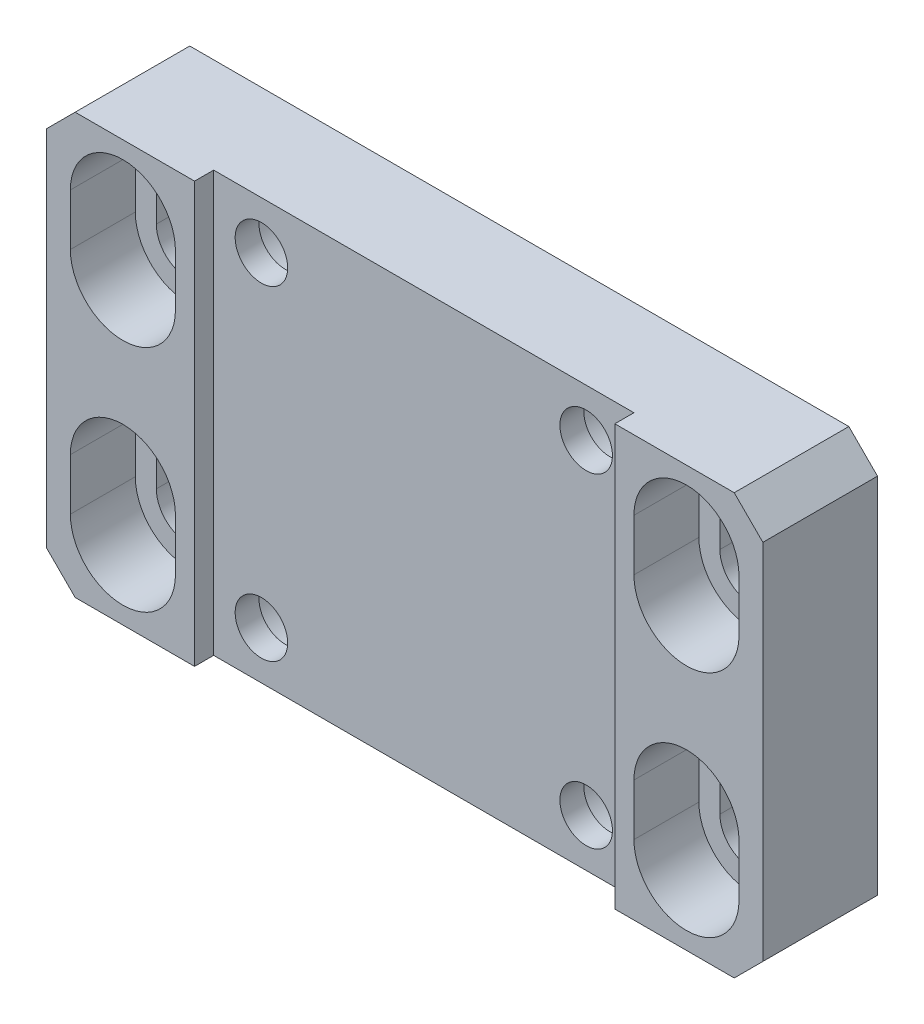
ISO-10303-21;
HEADER;
FILE_DESCRIPTION(('STEP AP214'),'2;1');
FILE_NAME('part.step','',(''),(''),'','','');
FILE_SCHEMA(('AUTOMOTIVE_DESIGN { 1 0 10303 214 1 1 1 1 }'));
ENDSEC;
DATA;
#1=APPLICATION_CONTEXT('core data for automotive mechanical design processes');
#2=APPLICATION_PROTOCOL_DEFINITION('international standard','automotive_design',2000,#1);
#3=PRODUCT_CONTEXT('',#1,'mechanical');
#4=PRODUCT('Part','Part','',(#3));
#5=PRODUCT_RELATED_PRODUCT_CATEGORY('part','',(#4));
#6=PRODUCT_DEFINITION_FORMATION('','',#4);
#7=PRODUCT_DEFINITION_CONTEXT('part definition',#1,'design');
#8=PRODUCT_DEFINITION('design','',#6,#7);
#9=PRODUCT_DEFINITION_SHAPE('','',#8);
#10=(LENGTH_UNIT() NAMED_UNIT(*) SI_UNIT(.MILLI.,.METRE.));
#11=(NAMED_UNIT(*) PLANE_ANGLE_UNIT() SI_UNIT($,.RADIAN.));
#12=(NAMED_UNIT(*) SI_UNIT($,.STERADIAN.) SOLID_ANGLE_UNIT());
#13=UNCERTAINTY_MEASURE_WITH_UNIT(LENGTH_MEASURE(1.E-05),#10,'distance_accuracy_value','');
#14=(GEOMETRIC_REPRESENTATION_CONTEXT(3) GLOBAL_UNCERTAINTY_ASSIGNED_CONTEXT((#13)) GLOBAL_UNIT_ASSIGNED_CONTEXT((#10,
#11,#12)) REPRESENTATION_CONTEXT('',''));
#15=CARTESIAN_POINT('',(0.,0.,0.));
#16=DIRECTION('',(0.,0.,1.));
#17=DIRECTION('',(1.,0.,0.));
#18=AXIS2_PLACEMENT_3D('',#15,#16,#17);
#19=CARTESIAN_POINT('',(0.,0.,12.));
#20=DIRECTION('',(0.,0.,1.));
#21=DIRECTION('',(1.,0.,0.));
#22=AXIS2_PLACEMENT_3D('',#19,#20,#21);
#23=PLANE('',#22);
#24=CARTESIAN_POINT('',(215.540678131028,-103.784490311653,12.));
#25=DIRECTION('',(0.,0.,1.));
#26=DIRECTION('',(1.,0.,0.));
#27=AXIS2_PLACEMENT_3D('',#24,#25,#26);
#28=CIRCLE('',#27,5.5);
#29=CARTESIAN_POINT('',(210.040678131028,-103.784490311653,12.));
#30=VERTEX_POINT('',#29);
#31=CARTESIAN_POINT('',(221.040678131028,-103.784490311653,12.));
#32=VERTEX_POINT('',#31);
#33=EDGE_CURVE('E407',#30,#32,#28,.T.);
#34=ORIENTED_EDGE('',*,*,#33,.F.);
#35=DIRECTION('',(0.,-1.,0.));
#36=VECTOR('',#35,1.);
#37=CARTESIAN_POINT('',(210.040678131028,-98.3844903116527,12.));
#38=LINE('',#37,#36);
#39=CARTESIAN_POINT('',(210.040678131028,-98.3844903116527,12.));
#40=VERTEX_POINT('',#39);
#41=EDGE_CURVE('E357',#40,#30,#38,.T.);
#42=ORIENTED_EDGE('',*,*,#41,.F.);
#43=CARTESIAN_POINT('',(215.540678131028,-98.3844903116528,12.));
#44=DIRECTION('',(0.,0.,1.));
#45=DIRECTION('',(1.,0.,0.));
#46=AXIS2_PLACEMENT_3D('',#43,#44,#45);
#47=CIRCLE('',#46,5.5);
#48=CARTESIAN_POINT('',(221.040678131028,-98.3844903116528,12.));
#49=VERTEX_POINT('',#48);
#50=EDGE_CURVE('E386',#49,#40,#47,.T.);
#51=ORIENTED_EDGE('',*,*,#50,.F.);
#52=DIRECTION('',(0.,-1.,0.));
#53=VECTOR('',#52,1.);
#54=CARTESIAN_POINT('',(221.040678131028,-98.3844903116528,12.));
#55=LINE('',#54,#53);
#56=EDGE_CURVE('E374',#49,#32,#55,.T.);
#57=ORIENTED_EDGE('',*,*,#56,.T.);
#58=EDGE_LOOP('',(#34,#42,#51,#57));
#59=FACE_BOUND('',#58,.T.);
#60=DIRECTION('',(-1.,0.,0.));
#61=VECTOR('',#60,1.);
#62=CARTESIAN_POINT('',(207.540678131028,-67.0844903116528,12.));
#63=LINE('',#62,#61);
#64=CARTESIAN_POINT('',(223.040678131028,-67.0844903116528,12.));
#65=VERTEX_POINT('',#64);
#66=CARTESIAN_POINT('',(210.540678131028,-67.0844903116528,12.));
#67=VERTEX_POINT('',#66);
#68=EDGE_CURVE('E618',#65,#67,#63,.T.);
#69=ORIENTED_EDGE('',*,*,#68,.T.);
#70=DIRECTION('',(0.707106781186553,0.707106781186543,0.));
#71=VECTOR('',#70,1.);
#72=CARTESIAN_POINT('',(138.812584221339,-138.812584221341,12.));
#73=LINE('',#72,#71);
#74=CARTESIAN_POINT('',(207.540678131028,-70.0844903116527,12.));
#75=VERTEX_POINT('',#74);
#76=EDGE_CURVE('E673',#67,#75,#73,.F.);
#77=ORIENTED_EDGE('',*,*,#76,.T.);
#78=DIRECTION('',(0.,-1.,0.));
#79=VECTOR('',#78,1.);
#80=CARTESIAN_POINT('',(207.540678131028,-67.0844903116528,12.));
#81=LINE('',#80,#79);
#82=CARTESIAN_POINT('',(207.540678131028,-108.084490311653,12.));
#83=VERTEX_POINT('',#82);
#84=EDGE_CURVE('E609',#75,#83,#81,.T.);
#85=ORIENTED_EDGE('',*,*,#84,.T.);
#86=DIRECTION('',(-0.707106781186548,0.707106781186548,0.));
#87=VECTOR('',#86,1.);
#88=CARTESIAN_POINT('',(49.7280939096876,49.7280939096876,12.));
#89=LINE('',#88,#87);
#90=CARTESIAN_POINT('',(210.540678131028,-111.084490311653,12.));
#91=VERTEX_POINT('',#90);
#92=EDGE_CURVE('E31',#83,#91,#89,.F.);
#93=ORIENTED_EDGE('',*,*,#92,.T.);
#94=DIRECTION('',(1.,0.,0.));
#95=VECTOR('',#94,1.);
#96=CARTESIAN_POINT('',(207.540678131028,-111.084490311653,12.));
#97=LINE('',#96,#95);
#98=CARTESIAN_POINT('',(223.040678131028,-111.084490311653,12.));
#99=VERTEX_POINT('',#98);
#100=EDGE_CURVE('E613',#91,#99,#97,.T.);
#101=ORIENTED_EDGE('',*,*,#100,.T.);
#102=DIRECTION('',(0.,1.,0.));
#103=VECTOR('',#102,1.);
#104=CARTESIAN_POINT('',(223.040678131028,-111.084490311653,12.));
#105=LINE('',#104,#103);
#106=EDGE_CURVE('E592',#99,#65,#105,.T.);
#107=ORIENTED_EDGE('',*,*,#106,.T.);
#108=EDGE_LOOP('',(#69,#77,#85,#93,#101,#107));
#109=FACE_BOUND('',#108,.T.);
#110=CARTESIAN_POINT('',(215.540678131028,-74.3844903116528,12.));
#111=DIRECTION('',(0.,0.,1.));
#112=DIRECTION('',(1.,0.,0.));
#113=AXIS2_PLACEMENT_3D('',#110,#111,#112);
#114=CIRCLE('',#113,5.5);
#115=CARTESIAN_POINT('',(221.040678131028,-74.3844903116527,12.));
#116=VERTEX_POINT('',#115);
#117=CARTESIAN_POINT('',(210.040678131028,-74.3844903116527,12.));
#118=VERTEX_POINT('',#117);
#119=EDGE_CURVE('E316',#116,#118,#114,.T.);
#120=ORIENTED_EDGE('',*,*,#119,.F.);
#121=DIRECTION('',(0.,-1.,0.));
#122=VECTOR('',#121,1.);
#123=CARTESIAN_POINT('',(221.040678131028,-74.3844903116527,12.));
#124=LINE('',#123,#122);
#125=CARTESIAN_POINT('',(221.040678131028,-79.7844903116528,12.));
#126=VERTEX_POINT('',#125);
#127=EDGE_CURVE('E300',#116,#126,#124,.T.);
#128=ORIENTED_EDGE('',*,*,#127,.T.);
#129=CARTESIAN_POINT('',(215.540678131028,-79.7844903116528,12.));
#130=DIRECTION('',(0.,0.,1.));
#131=DIRECTION('',(1.,0.,0.));
#132=AXIS2_PLACEMENT_3D('',#129,#130,#131);
#133=CIRCLE('',#132,5.5);
#134=CARTESIAN_POINT('',(210.040678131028,-79.7844903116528,12.));
#135=VERTEX_POINT('',#134);
#136=EDGE_CURVE('E343',#135,#126,#133,.T.);
#137=ORIENTED_EDGE('',*,*,#136,.F.);
#138=DIRECTION('',(0.,-1.,0.));
#139=VECTOR('',#138,1.);
#140=CARTESIAN_POINT('',(210.040678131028,-74.3844903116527,12.));
#141=LINE('',#140,#139);
#142=EDGE_CURVE('E323',#118,#135,#141,.T.);
#143=ORIENTED_EDGE('',*,*,#142,.F.);
#144=EDGE_LOOP('',(#120,#128,#137,#143));
#145=FACE_BOUND('',#144,.T.);
#146=ADVANCED_FACE('F16',(#59,#109,#145),#23,.T.);
#147=CARTESIAN_POINT('',(0.,0.,0.));
#148=DIRECTION('',(0.,0.,1.));
#149=DIRECTION('',(1.,0.,0.));
#150=AXIS2_PLACEMENT_3D('',#147,#148,#149);
#151=PLANE('',#150);
#152=DIRECTION('',(0.,-1.,0.));
#153=VECTOR('',#152,1.);
#154=CARTESIAN_POINT('',(212.240678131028,-74.3844903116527,0.));
#155=LINE('',#154,#153);
#156=CARTESIAN_POINT('',(212.240678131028,-74.3844903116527,0.));
#157=VERTEX_POINT('',#156);
#158=CARTESIAN_POINT('',(212.240678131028,-79.7844903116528,0.));
#159=VERTEX_POINT('',#158);
#160=EDGE_CURVE('E1367',#157,#159,#155,.T.);
#161=ORIENTED_EDGE('',*,*,#160,.T.);
#162=CARTESIAN_POINT('',(215.540678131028,-79.7844903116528,0.));
#163=DIRECTION('',(0.,0.,1.));
#164=DIRECTION('',(1.,0.,0.));
#165=AXIS2_PLACEMENT_3D('',#162,#163,#164);
#166=CIRCLE('',#165,3.3);
#167=CARTESIAN_POINT('',(218.840678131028,-79.7844903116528,0.));
#168=VERTEX_POINT('',#167);
#169=EDGE_CURVE('E351',#159,#168,#166,.T.);
#170=ORIENTED_EDGE('',*,*,#169,.T.);
#171=DIRECTION('',(0.,-1.,0.));
#172=VECTOR('',#171,1.);
#173=CARTESIAN_POINT('',(218.840678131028,-74.3844903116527,0.));
#174=LINE('',#173,#172);
#175=CARTESIAN_POINT('',(218.840678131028,-74.3844903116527,0.));
#176=VERTEX_POINT('',#175);
#177=EDGE_CURVE('E1366',#176,#168,#174,.T.);
#178=ORIENTED_EDGE('',*,*,#177,.F.);
#179=CARTESIAN_POINT('',(215.540678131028,-74.3844903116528,0.));
#180=DIRECTION('',(0.,0.,1.));
#181=DIRECTION('',(1.,0.,0.));
#182=AXIS2_PLACEMENT_3D('',#179,#180,#181);
#183=CIRCLE('',#182,3.3);
#184=EDGE_CURVE('E332',#176,#157,#183,.T.);
#185=ORIENTED_EDGE('',*,*,#184,.T.);
#186=EDGE_LOOP('',(#161,#170,#178,#185));
#187=FACE_BOUND('',#186,.T.);
#188=DIRECTION('',(0.,-1.,0.));
#189=VECTOR('',#188,1.);
#190=CARTESIAN_POINT('',(277.840678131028,-98.3844903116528,0.));
#191=LINE('',#190,#189);
#192=CARTESIAN_POINT('',(277.840678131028,-98.3844903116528,0.));
#193=VERTEX_POINT('',#192);
#194=CARTESIAN_POINT('',(277.840678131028,-103.784490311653,0.));
#195=VERTEX_POINT('',#194);
#196=EDGE_CURVE('E494',#193,#195,#191,.T.);
#197=ORIENTED_EDGE('',*,*,#196,.F.);
#198=CARTESIAN_POINT('',(274.540678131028,-98.3844903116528,0.));
#199=DIRECTION('',(0.,0.,1.));
#200=DIRECTION('',(1.,0.,0.));
#201=AXIS2_PLACEMENT_3D('',#198,#199,#200);
#202=CIRCLE('',#201,3.3);
#203=CARTESIAN_POINT('',(271.240678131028,-98.3844903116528,0.));
#204=VERTEX_POINT('',#203);
#205=EDGE_CURVE('E522',#193,#204,#202,.T.);
#206=ORIENTED_EDGE('',*,*,#205,.T.);
#207=DIRECTION('',(0.,-1.,0.));
#208=VECTOR('',#207,1.);
#209=CARTESIAN_POINT('',(271.240678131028,-98.3844903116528,0.));
#210=LINE('',#209,#208);
#211=CARTESIAN_POINT('',(271.240678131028,-103.784490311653,0.));
#212=VERTEX_POINT('',#211);
#213=EDGE_CURVE('E491',#204,#212,#210,.T.);
#214=ORIENTED_EDGE('',*,*,#213,.T.);
#215=CARTESIAN_POINT('',(274.540678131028,-103.784490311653,0.));
#216=DIRECTION('',(0.,0.,1.));
#217=DIRECTION('',(1.,0.,0.));
#218=AXIS2_PLACEMENT_3D('',#215,#216,#217);
#219=CIRCLE('',#218,3.3);
#220=EDGE_CURVE('E543',#212,#195,#219,.T.);
#221=ORIENTED_EDGE('',*,*,#220,.T.);
#222=EDGE_LOOP('',(#197,#206,#214,#221));
#223=FACE_BOUND('',#222,.T.);
#224=CARTESIAN_POINT('',(228.040678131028,-106.084490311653,0.));
#225=DIRECTION('',(0.,0.,-1.));
#226=DIRECTION('',(-1.,0.,0.));
#227=AXIS2_PLACEMENT_3D('',#224,#225,#226);
#228=CIRCLE('',#227,4.9);
#229=CARTESIAN_POINT('',(223.140678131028,-106.084490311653,0.));
#230=VERTEX_POINT('',#229);
#231=EDGE_CURVE('E549',#230,#230,#228,.T.);
#232=ORIENTED_EDGE('',*,*,#231,.F.);
#233=EDGE_LOOP('',(#232));
#234=FACE_BOUND('',#233,.T.);
#235=CARTESIAN_POINT('',(262.040678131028,-106.084490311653,0.));
#236=DIRECTION('',(0.,0.,-1.));
#237=DIRECTION('',(-1.,0.,0.));
#238=AXIS2_PLACEMENT_3D('',#235,#236,#237);
#239=CIRCLE('',#238,4.9);
#240=CARTESIAN_POINT('',(257.140678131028,-106.084490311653,0.));
#241=VERTEX_POINT('',#240);
#242=EDGE_CURVE('E560',#241,#241,#239,.T.);
#243=ORIENTED_EDGE('',*,*,#242,.F.);
#244=EDGE_LOOP('',(#243));
#245=FACE_BOUND('',#244,.T.);
#246=CARTESIAN_POINT('',(228.040678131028,-72.0844903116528,0.));
#247=DIRECTION('',(0.,0.,-1.));
#248=DIRECTION('',(-1.,0.,0.));
#249=AXIS2_PLACEMENT_3D('',#246,#247,#248);
#250=CIRCLE('',#249,4.9);
#251=CARTESIAN_POINT('',(223.140678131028,-72.0844903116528,0.));
#252=VERTEX_POINT('',#251);
#253=EDGE_CURVE('E567',#252,#252,#250,.T.);
#254=ORIENTED_EDGE('',*,*,#253,.F.);
#255=EDGE_LOOP('',(#254));
#256=FACE_BOUND('',#255,.T.);
#257=CARTESIAN_POINT('',(262.040678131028,-72.0844903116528,0.));
#258=DIRECTION('',(0.,0.,-1.));
#259=DIRECTION('',(-1.,0.,0.));
#260=AXIS2_PLACEMENT_3D('',#257,#258,#259);
#261=CIRCLE('',#260,4.9);
#262=CARTESIAN_POINT('',(257.140678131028,-72.0844903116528,0.));
#263=VERTEX_POINT('',#262);
#264=EDGE_CURVE('E574',#263,#263,#261,.T.);
#265=ORIENTED_EDGE('',*,*,#264,.F.);
#266=EDGE_LOOP('',(#265));
#267=FACE_BOUND('',#266,.T.);
#268=DIRECTION('',(-1.,0.,0.));
#269=VECTOR('',#268,1.);
#270=CARTESIAN_POINT('',(207.540678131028,-67.0844903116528,0.));
#271=LINE('',#270,#269);
#272=CARTESIAN_POINT('',(279.540678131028,-67.0844903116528,0.));
#273=VERTEX_POINT('',#272);
#274=CARTESIAN_POINT('',(210.540678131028,-67.0844903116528,0.));
#275=VERTEX_POINT('',#274);
#276=EDGE_CURVE('E612',#273,#275,#271,.T.);
#277=ORIENTED_EDGE('',*,*,#276,.F.);
#278=DIRECTION('',(-0.707106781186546,0.707106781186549,0.));
#279=VECTOR('',#278,1.);
#280=CARTESIAN_POINT('',(279.540678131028,-67.0844903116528,0.));
#281=LINE('',#280,#279);
#282=CARTESIAN_POINT('',(282.540678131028,-70.0844903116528,0.));
#283=VERTEX_POINT('',#282);
#284=EDGE_CURVE('E657',#273,#283,#281,.F.);
#285=ORIENTED_EDGE('',*,*,#284,.T.);
#286=DIRECTION('',(0.,1.,0.));
#287=VECTOR('',#286,1.);
#288=CARTESIAN_POINT('',(282.540678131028,-67.0844903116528,0.));
#289=LINE('',#288,#287);
#290=CARTESIAN_POINT('',(282.540678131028,-108.084490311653,0.));
#291=VERTEX_POINT('',#290);
#292=EDGE_CURVE('E626',#291,#283,#289,.T.);
#293=ORIENTED_EDGE('',*,*,#292,.F.);
#294=DIRECTION('',(0.707106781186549,0.707106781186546,0.));
#295=VECTOR('',#294,1.);
#296=CARTESIAN_POINT('',(282.540678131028,-108.084490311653,0.));
#297=LINE('',#296,#295);
#298=CARTESIAN_POINT('',(279.540678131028,-111.084490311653,0.));
#299=VERTEX_POINT('',#298);
#300=EDGE_CURVE('E651',#291,#299,#297,.F.);
#301=ORIENTED_EDGE('',*,*,#300,.T.);
#302=DIRECTION('',(1.,0.,0.));
#303=VECTOR('',#302,1.);
#304=CARTESIAN_POINT('',(207.540678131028,-111.084490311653,0.));
#305=LINE('',#304,#303);
#306=CARTESIAN_POINT('',(210.540678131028,-111.084490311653,0.));
#307=VERTEX_POINT('',#306);
#308=EDGE_CURVE('E623',#307,#299,#305,.T.);
#309=ORIENTED_EDGE('',*,*,#308,.F.);
#310=DIRECTION('',(0.707106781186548,-0.707106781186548,0.));
#311=VECTOR('',#310,1.);
#312=CARTESIAN_POINT('',(210.540678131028,-111.084490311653,0.));
#313=LINE('',#312,#311);
#314=CARTESIAN_POINT('',(207.540678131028,-108.084490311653,0.));
#315=VERTEX_POINT('',#314);
#316=EDGE_CURVE('E653',#307,#315,#313,.F.);
#317=ORIENTED_EDGE('',*,*,#316,.T.);
#318=DIRECTION('',(0.,-1.,0.));
#319=VECTOR('',#318,1.);
#320=CARTESIAN_POINT('',(207.540678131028,-67.0844903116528,0.));
#321=LINE('',#320,#319);
#322=CARTESIAN_POINT('',(207.540678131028,-70.0844903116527,0.));
#323=VERTEX_POINT('',#322);
#324=EDGE_CURVE('E601',#323,#315,#321,.T.);
#325=ORIENTED_EDGE('',*,*,#324,.F.);
#326=DIRECTION('',(-0.707106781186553,-0.707106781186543,0.));
#327=VECTOR('',#326,1.);
#328=CARTESIAN_POINT('',(207.540678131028,-70.0844903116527,0.));
#329=LINE('',#328,#327);
#330=EDGE_CURVE('E655',#323,#275,#329,.F.);
#331=ORIENTED_EDGE('',*,*,#330,.T.);
#332=EDGE_LOOP('',(#277,#285,#293,#301,#309,#317,#325,#331));
#333=FACE_BOUND('',#332,.T.);
#334=DIRECTION('',(0.,-1.,0.));
#335=VECTOR('',#334,1.);
#336=CARTESIAN_POINT('',(271.240678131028,-74.3844903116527,0.));
#337=LINE('',#336,#335);
#338=CARTESIAN_POINT('',(271.240678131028,-74.3844903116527,0.));
#339=VERTEX_POINT('',#338);
#340=CARTESIAN_POINT('',(271.240678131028,-79.7844903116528,0.));
#341=VERTEX_POINT('',#340);
#342=EDGE_CURVE('E427',#339,#341,#337,.T.);
#343=ORIENTED_EDGE('',*,*,#342,.T.);
#344=CARTESIAN_POINT('',(274.540678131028,-79.7844903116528,0.));
#345=DIRECTION('',(0.,0.,1.));
#346=DIRECTION('',(1.,0.,0.));
#347=AXIS2_PLACEMENT_3D('',#344,#345,#346);
#348=CIRCLE('',#347,3.3);
#349=CARTESIAN_POINT('',(277.840678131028,-79.7844903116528,0.));
#350=VERTEX_POINT('',#349);
#351=EDGE_CURVE('E479',#341,#350,#348,.T.);
#352=ORIENTED_EDGE('',*,*,#351,.T.);
#353=DIRECTION('',(0.,-1.,0.));
#354=VECTOR('',#353,1.);
#355=CARTESIAN_POINT('',(277.840678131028,-74.3844903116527,0.));
#356=LINE('',#355,#354);
#357=CARTESIAN_POINT('',(277.840678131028,-74.3844903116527,0.));
#358=VERTEX_POINT('',#357);
#359=EDGE_CURVE('E430',#358,#350,#356,.T.);
#360=ORIENTED_EDGE('',*,*,#359,.F.);
#361=CARTESIAN_POINT('',(274.540678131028,-74.3844903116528,0.));
#362=DIRECTION('',(0.,0.,1.));
#363=DIRECTION('',(1.,0.,0.));
#364=AXIS2_PLACEMENT_3D('',#361,#362,#363);
#365=CIRCLE('',#364,3.3);
#366=EDGE_CURVE('E458',#358,#339,#365,.T.);
#367=ORIENTED_EDGE('',*,*,#366,.T.);
#368=EDGE_LOOP('',(#343,#352,#360,#367));
#369=FACE_BOUND('',#368,.T.);
#370=DIRECTION('',(0.,-1.,0.));
#371=VECTOR('',#370,1.);
#372=CARTESIAN_POINT('',(218.840678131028,-98.3844903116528,0.));
#373=LINE('',#372,#371);
#374=CARTESIAN_POINT('',(218.840678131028,-98.3844903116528,0.));
#375=VERTEX_POINT('',#374);
#376=CARTESIAN_POINT('',(218.840678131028,-103.784490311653,0.));
#377=VERTEX_POINT('',#376);
#378=EDGE_CURVE('E366',#375,#377,#373,.T.);
#379=ORIENTED_EDGE('',*,*,#378,.F.);
#380=CARTESIAN_POINT('',(215.540678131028,-98.3844903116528,0.));
#381=DIRECTION('',(0.,0.,1.));
#382=DIRECTION('',(1.,0.,0.));
#383=AXIS2_PLACEMENT_3D('',#380,#381,#382);
#384=CIRCLE('',#383,3.3);
#385=CARTESIAN_POINT('',(212.240678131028,-98.3844903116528,0.));
#386=VERTEX_POINT('',#385);
#387=EDGE_CURVE('E394',#375,#386,#384,.T.);
#388=ORIENTED_EDGE('',*,*,#387,.T.);
#389=DIRECTION('',(0.,-1.,0.));
#390=VECTOR('',#389,1.);
#391=CARTESIAN_POINT('',(212.240678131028,-98.3844903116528,0.));
#392=LINE('',#391,#390);
#393=CARTESIAN_POINT('',(212.240678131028,-103.784490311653,0.));
#394=VERTEX_POINT('',#393);
#395=EDGE_CURVE('E363',#386,#394,#392,.T.);
#396=ORIENTED_EDGE('',*,*,#395,.T.);
#397=CARTESIAN_POINT('',(215.540678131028,-103.784490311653,0.));
#398=DIRECTION('',(0.,0.,1.));
#399=DIRECTION('',(1.,0.,0.));
#400=AXIS2_PLACEMENT_3D('',#397,#398,#399);
#401=CIRCLE('',#400,3.3);
#402=EDGE_CURVE('E415',#394,#377,#401,.T.);
#403=ORIENTED_EDGE('',*,*,#402,.T.);
#404=EDGE_LOOP('',(#379,#388,#396,#403));
#405=FACE_BOUND('',#404,.T.);
#406=ADVANCED_FACE('F694',(#187,#223,#234,#245,#256,#267,#333,#369,#405),#151,.F.);
#407=CARTESIAN_POINT('',(274.540678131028,-79.7844903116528,12.));
#408=DIRECTION('',(0.,0.,1.));
#409=DIRECTION('',(1.,0.,0.));
#410=AXIS2_PLACEMENT_3D('',#407,#408,#409);
#411=CIRCLE('',#410,5.5);
#412=CARTESIAN_POINT('',(269.040678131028,-79.7844903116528,12.));
#413=VERTEX_POINT('',#412);
#414=CARTESIAN_POINT('',(280.040678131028,-79.7844903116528,12.));
#415=VERTEX_POINT('',#414);
#416=EDGE_CURVE('E471',#413,#415,#411,.T.);
#417=ORIENTED_EDGE('',*,*,#416,.F.);
#418=DIRECTION('',(0.,-1.,0.));
#419=VECTOR('',#418,1.);
#420=CARTESIAN_POINT('',(269.040678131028,-74.3844903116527,12.));
#421=LINE('',#420,#419);
#422=CARTESIAN_POINT('',(269.040678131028,-74.3844903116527,12.));
#423=VERTEX_POINT('',#422);
#424=EDGE_CURVE('E421',#423,#413,#421,.T.);
#425=ORIENTED_EDGE('',*,*,#424,.F.);
#426=CARTESIAN_POINT('',(274.540678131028,-74.3844903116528,12.));
#427=DIRECTION('',(0.,0.,1.));
#428=DIRECTION('',(1.,0.,0.));
#429=AXIS2_PLACEMENT_3D('',#426,#427,#428);
#430=CIRCLE('',#429,5.5);
#431=CARTESIAN_POINT('',(280.040678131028,-74.3844903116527,12.));
#432=VERTEX_POINT('',#431);
#433=EDGE_CURVE('E450',#432,#423,#430,.T.);
#434=ORIENTED_EDGE('',*,*,#433,.F.);
#435=DIRECTION('',(0.,-1.,0.));
#436=VECTOR('',#435,1.);
#437=CARTESIAN_POINT('',(280.040678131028,-74.3844903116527,12.));
#438=LINE('',#437,#436);
#439=EDGE_CURVE('E438',#432,#415,#438,.T.);
#440=ORIENTED_EDGE('',*,*,#439,.T.);
#441=EDGE_LOOP('',(#417,#425,#434,#440));
#442=FACE_BOUND('',#441,.T.);
#443=DIRECTION('',(0.,1.,0.));
#444=VECTOR('',#443,1.);
#445=CARTESIAN_POINT('',(282.540678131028,-67.0844903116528,12.));
#446=LINE('',#445,#444);
#447=CARTESIAN_POINT('',(282.540678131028,-108.084490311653,12.));
#448=VERTEX_POINT('',#447);
#449=CARTESIAN_POINT('',(282.540678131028,-70.0844903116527,12.));
#450=VERTEX_POINT('',#449);
#451=EDGE_CURVE('E615',#448,#450,#446,.T.);
#452=ORIENTED_EDGE('',*,*,#451,.T.);
#453=DIRECTION('',(0.707106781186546,-0.707106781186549,0.));
#454=VECTOR('',#453,1.);
#455=CARTESIAN_POINT('',(106.228093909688,106.228093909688,12.));
#456=LINE('',#455,#454);
#457=CARTESIAN_POINT('',(279.540678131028,-67.0844903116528,12.));
#458=VERTEX_POINT('',#457);
#459=EDGE_CURVE('E666',#450,#458,#456,.F.);
#460=ORIENTED_EDGE('',*,*,#459,.T.);
#461=CARTESIAN_POINT('',(267.040678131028,-67.0844903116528,12.));
#462=VERTEX_POINT('',#461);
#463=EDGE_CURVE('E619',#458,#462,#63,.T.);
#464=ORIENTED_EDGE('',*,*,#463,.T.);
#465=DIRECTION('',(0.,1.,0.));
#466=VECTOR('',#465,1.);
#467=CARTESIAN_POINT('',(267.040678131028,-111.084490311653,12.));
#468=LINE('',#467,#466);
#469=CARTESIAN_POINT('',(267.040678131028,-111.084490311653,12.));
#470=VERTEX_POINT('',#469);
#471=EDGE_CURVE('E604',#470,#462,#468,.T.);
#472=ORIENTED_EDGE('',*,*,#471,.F.);
#473=CARTESIAN_POINT('',(279.540678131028,-111.084490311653,12.));
#474=VERTEX_POINT('',#473);
#475=EDGE_CURVE('E611',#470,#474,#97,.T.);
#476=ORIENTED_EDGE('',*,*,#475,.T.);
#477=DIRECTION('',(-0.707106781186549,-0.707106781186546,0.));
#478=VECTOR('',#477,1.);
#479=CARTESIAN_POINT('',(195.31258422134,-195.312584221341,12.));
#480=LINE('',#479,#478);
#481=EDGE_CURVE('E664',#474,#448,#480,.F.);
#482=ORIENTED_EDGE('',*,*,#481,.T.);
#483=EDGE_LOOP('',(#452,#460,#464,#472,#476,#482));
#484=FACE_BOUND('',#483,.T.);
#485=CARTESIAN_POINT('',(274.540678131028,-98.3844903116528,12.));
#486=DIRECTION('',(0.,0.,1.));
#487=DIRECTION('',(1.,0.,0.));
#488=AXIS2_PLACEMENT_3D('',#485,#486,#487);
#489=CIRCLE('',#488,5.5);
#490=CARTESIAN_POINT('',(280.040678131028,-98.3844903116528,12.));
#491=VERTEX_POINT('',#490);
#492=CARTESIAN_POINT('',(269.040678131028,-98.3844903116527,12.));
#493=VERTEX_POINT('',#492);
#494=EDGE_CURVE('E514',#491,#493,#489,.T.);
#495=ORIENTED_EDGE('',*,*,#494,.F.);
#496=DIRECTION('',(0.,-1.,0.));
#497=VECTOR('',#496,1.);
#498=CARTESIAN_POINT('',(280.040678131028,-98.3844903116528,12.));
#499=LINE('',#498,#497);
#500=CARTESIAN_POINT('',(280.040678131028,-103.784490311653,12.));
#501=VERTEX_POINT('',#500);
#502=EDGE_CURVE('E502',#491,#501,#499,.T.);
#503=ORIENTED_EDGE('',*,*,#502,.T.);
#504=CARTESIAN_POINT('',(274.540678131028,-103.784490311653,12.));
#505=DIRECTION('',(0.,0.,1.));
#506=DIRECTION('',(1.,0.,0.));
#507=AXIS2_PLACEMENT_3D('',#504,#505,#506);
#508=CIRCLE('',#507,5.5);
#509=CARTESIAN_POINT('',(269.040678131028,-103.784490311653,12.));
#510=VERTEX_POINT('',#509);
#511=EDGE_CURVE('E535',#510,#501,#508,.T.);
#512=ORIENTED_EDGE('',*,*,#511,.F.);
#513=DIRECTION('',(0.,-1.,0.));
#514=VECTOR('',#513,1.);
#515=CARTESIAN_POINT('',(269.040678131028,-98.3844903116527,12.));
#516=LINE('',#515,#514);
#517=EDGE_CURVE('E485',#493,#510,#516,.T.);
#518=ORIENTED_EDGE('',*,*,#517,.F.);
#519=EDGE_LOOP('',(#495,#503,#512,#518));
#520=FACE_BOUND('',#519,.T.);
#521=ADVANCED_FACE('F684',(#442,#484,#520),#23,.T.);
#522=CARTESIAN_POINT('',(228.040678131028,-106.084490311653,0.));
#523=DIRECTION('',(0.,0.,-1.));
#524=DIRECTION('',(-1.,0.,0.));
#525=AXIS2_PLACEMENT_3D('',#522,#523,#524);
#526=CYLINDRICAL_SURFACE('',#525,2.75);
#527=CARTESIAN_POINT('',(228.040678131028,-106.084490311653,10.));
#528=DIRECTION('',(0.,0.,-1.));
#529=DIRECTION('',(-1.,0.,0.));
#530=AXIS2_PLACEMENT_3D('',#527,#528,#529);
#531=CIRCLE('',#530,2.75);
#532=CARTESIAN_POINT('',(225.290678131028,-106.084490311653,10.));
#533=VERTEX_POINT('',#532);
#534=EDGE_CURVE('E633',#533,#533,#531,.T.);
#535=ORIENTED_EDGE('',*,*,#534,.F.);
#536=EDGE_LOOP('',(#535));
#537=FACE_BOUND('',#536,.T.);
#538=CARTESIAN_POINT('',(228.040678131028,-106.084490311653,7.5));
#539=DIRECTION('',(0.,0.,-1.));
#540=DIRECTION('',(-1.,0.,0.));
#541=AXIS2_PLACEMENT_3D('',#538,#539,#540);
#542=CIRCLE('',#541,2.75);
#543=CARTESIAN_POINT('',(225.290678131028,-106.084490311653,7.5));
#544=VERTEX_POINT('',#543);
#545=EDGE_CURVE('E553',#544,#544,#542,.F.);
#546=ORIENTED_EDGE('',*,*,#545,.F.);
#547=EDGE_LOOP('',(#546));
#548=FACE_BOUND('',#547,.T.);
#549=ADVANCED_FACE('F747',(#537,#548),#526,.F.);
#550=CARTESIAN_POINT('',(262.040678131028,-106.084490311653,0.));
#551=DIRECTION('',(0.,0.,-1.));
#552=DIRECTION('',(-1.,0.,0.));
#553=AXIS2_PLACEMENT_3D('',#550,#551,#552);
#554=CYLINDRICAL_SURFACE('',#553,2.75);
#555=CARTESIAN_POINT('',(262.040678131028,-106.084490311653,10.));
#556=DIRECTION('',(0.,0.,-1.));
#557=DIRECTION('',(-1.,0.,0.));
#558=AXIS2_PLACEMENT_3D('',#555,#556,#557);
#559=CIRCLE('',#558,2.75);
#560=CARTESIAN_POINT('',(259.290678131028,-106.084490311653,10.));
#561=VERTEX_POINT('',#560);
#562=EDGE_CURVE('E581',#561,#561,#559,.T.);
#563=ORIENTED_EDGE('',*,*,#562,.F.);
#564=EDGE_LOOP('',(#563));
#565=FACE_BOUND('',#564,.T.);
#566=CARTESIAN_POINT('',(262.040678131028,-106.084490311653,7.5));
#567=DIRECTION('',(0.,0.,-1.));
#568=DIRECTION('',(-1.,0.,0.));
#569=AXIS2_PLACEMENT_3D('',#566,#567,#568);
#570=CIRCLE('',#569,2.75);
#571=CARTESIAN_POINT('',(259.290678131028,-106.084490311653,7.5));
#572=VERTEX_POINT('',#571);
#573=EDGE_CURVE('E559',#572,#572,#570,.F.);
#574=ORIENTED_EDGE('',*,*,#573,.F.);
#575=EDGE_LOOP('',(#574));
#576=FACE_BOUND('',#575,.T.);
#577=ADVANCED_FACE('F753',(#565,#576),#554,.F.);
#578=CARTESIAN_POINT('',(228.040678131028,-72.0844903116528,0.));
#579=DIRECTION('',(0.,0.,-1.));
#580=DIRECTION('',(-1.,0.,0.));
#581=AXIS2_PLACEMENT_3D('',#578,#579,#580);
#582=CYLINDRICAL_SURFACE('',#581,2.75);
#583=CARTESIAN_POINT('',(228.040678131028,-72.0844903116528,10.));
#584=DIRECTION('',(0.,0.,-1.));
#585=DIRECTION('',(-1.,0.,0.));
#586=AXIS2_PLACEMENT_3D('',#583,#584,#585);
#587=CIRCLE('',#586,2.75);
#588=CARTESIAN_POINT('',(225.290678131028,-72.0844903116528,10.));
#589=VERTEX_POINT('',#588);
#590=EDGE_CURVE('E636',#589,#589,#587,.T.);
#591=ORIENTED_EDGE('',*,*,#590,.F.);
#592=EDGE_LOOP('',(#591));
#593=FACE_BOUND('',#592,.T.);
#594=CARTESIAN_POINT('',(228.040678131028,-72.0844903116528,7.5));
#595=DIRECTION('',(0.,0.,-1.));
#596=DIRECTION('',(-1.,0.,0.));
#597=AXIS2_PLACEMENT_3D('',#594,#595,#596);
#598=CIRCLE('',#597,2.75);
#599=CARTESIAN_POINT('',(225.290678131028,-72.0844903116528,7.5));
#600=VERTEX_POINT('',#599);
#601=EDGE_CURVE('E566',#600,#600,#598,.F.);
#602=ORIENTED_EDGE('',*,*,#601,.F.);
#603=EDGE_LOOP('',(#602));
#604=FACE_BOUND('',#603,.T.);
#605=ADVANCED_FACE('F866',(#593,#604),#582,.F.);
#606=CARTESIAN_POINT('',(262.040678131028,-72.0844903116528,0.));
#607=DIRECTION('',(0.,0.,-1.));
#608=DIRECTION('',(-1.,0.,0.));
#609=AXIS2_PLACEMENT_3D('',#606,#607,#608);
#610=CYLINDRICAL_SURFACE('',#609,2.75);
#611=CARTESIAN_POINT('',(262.040678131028,-72.0844903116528,10.));
#612=DIRECTION('',(0.,0.,-1.));
#613=DIRECTION('',(-1.,0.,0.));
#614=AXIS2_PLACEMENT_3D('',#611,#612,#613);
#615=CIRCLE('',#614,2.75);
#616=CARTESIAN_POINT('',(259.290678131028,-72.0844903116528,10.));
#617=VERTEX_POINT('',#616);
#618=EDGE_CURVE('E577',#617,#617,#615,.T.);
#619=ORIENTED_EDGE('',*,*,#618,.F.);
#620=EDGE_LOOP('',(#619));
#621=FACE_BOUND('',#620,.T.);
#622=CARTESIAN_POINT('',(262.040678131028,-72.0844903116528,7.5));
#623=DIRECTION('',(0.,0.,-1.));
#624=DIRECTION('',(-1.,0.,0.));
#625=AXIS2_PLACEMENT_3D('',#622,#623,#624);
#626=CIRCLE('',#625,2.75);
#627=CARTESIAN_POINT('',(259.290678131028,-72.0844903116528,7.5));
#628=VERTEX_POINT('',#627);
#629=EDGE_CURVE('E573',#628,#628,#626,.F.);
#630=ORIENTED_EDGE('',*,*,#629,.F.);
#631=EDGE_LOOP('',(#630));
#632=FACE_BOUND('',#631,.T.);
#633=ADVANCED_FACE('F868',(#621,#632),#610,.F.);
#634=CARTESIAN_POINT('',(207.540678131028,-67.0844903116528,12.));
#635=DIRECTION('',(1.,0.,0.));
#636=DIRECTION('',(0.,0.,-1.));
#637=AXIS2_PLACEMENT_3D('',#634,#635,#636);
#638=PLANE('',#637);
#639=ORIENTED_EDGE('',*,*,#84,.F.);
#640=DIRECTION('',(0.,0.,-1.));
#641=VECTOR('',#640,1.);
#642=CARTESIAN_POINT('',(207.540678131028,-70.0844903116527,12.));
#643=LINE('',#642,#641);
#644=EDGE_CURVE('E669',#75,#323,#643,.T.);
#645=ORIENTED_EDGE('',*,*,#644,.T.);
#646=ORIENTED_EDGE('',*,*,#324,.T.);
#647=DIRECTION('',(0.,0.,1.));
#648=VECTOR('',#647,1.);
#649=CARTESIAN_POINT('',(207.540678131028,-108.084490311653,12.));
#650=LINE('',#649,#648);
#651=EDGE_CURVE('E39',#315,#83,#650,.T.);
#652=ORIENTED_EDGE('',*,*,#651,.T.);
#653=EDGE_LOOP('',(#639,#645,#646,#652));
#654=FACE_BOUND('',#653,.T.);
#655=ADVANCED_FACE('F722',(#654),#638,.F.);
#656=CARTESIAN_POINT('',(207.540678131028,-111.084490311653,12.));
#657=DIRECTION('',(0.,1.,0.));
#658=DIRECTION('',(0.,0.,1.));
#659=AXIS2_PLACEMENT_3D('',#656,#657,#658);
#660=PLANE('',#659);
#661=ORIENTED_EDGE('',*,*,#100,.F.);
#662=DIRECTION('',(0.,0.,-1.));
#663=VECTOR('',#662,1.);
#664=CARTESIAN_POINT('',(210.540678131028,-111.084490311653,12.));
#665=LINE('',#664,#663);
#666=EDGE_CURVE('E11',#91,#307,#665,.T.);
#667=ORIENTED_EDGE('',*,*,#666,.T.);
#668=ORIENTED_EDGE('',*,*,#308,.T.);
#669=DIRECTION('',(0.,0.,1.));
#670=VECTOR('',#669,1.);
#671=CARTESIAN_POINT('',(279.540678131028,-111.084490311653,12.));
#672=LINE('',#671,#670);
#673=EDGE_CURVE('E24',#299,#474,#672,.T.);
#674=ORIENTED_EDGE('',*,*,#673,.T.);
#675=ORIENTED_EDGE('',*,*,#475,.F.);
#676=DIRECTION('',(0.,0.,-1.));
#677=VECTOR('',#676,1.);
#678=CARTESIAN_POINT('',(267.040678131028,-111.084490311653,12.));
#679=LINE('',#678,#677);
#680=CARTESIAN_POINT('',(267.040678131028,-111.084490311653,10.));
#681=VERTEX_POINT('',#680);
#682=EDGE_CURVE('E585',#470,#681,#679,.T.);
#683=ORIENTED_EDGE('',*,*,#682,.T.);
#684=DIRECTION('',(-1.,0.,0.));
#685=VECTOR('',#684,1.);
#686=CARTESIAN_POINT('',(223.040678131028,-111.084490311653,10.));
#687=LINE('',#686,#685);
#688=CARTESIAN_POINT('',(223.040678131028,-111.084490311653,10.));
#689=VERTEX_POINT('',#688);
#690=EDGE_CURVE('E589',#681,#689,#687,.T.);
#691=ORIENTED_EDGE('',*,*,#690,.T.);
#692=DIRECTION('',(0.,0.,1.));
#693=VECTOR('',#692,1.);
#694=CARTESIAN_POINT('',(223.040678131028,-111.084490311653,12.));
#695=LINE('',#694,#693);
#696=EDGE_CURVE('E582',#689,#99,#695,.T.);
#697=ORIENTED_EDGE('',*,*,#696,.T.);
#698=EDGE_LOOP('',(#661,#667,#668,#674,#675,#683,#691,#697));
#699=FACE_BOUND('',#698,.T.);
#700=ADVANCED_FACE('F678',(#699),#660,.F.);
#701=CARTESIAN_POINT('',(282.540678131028,-67.0844903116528,12.));
#702=DIRECTION('',(-1.,0.,0.));
#703=DIRECTION('',(0.,0.,1.));
#704=AXIS2_PLACEMENT_3D('',#701,#702,#703);
#705=PLANE('',#704);
#706=ORIENTED_EDGE('',*,*,#292,.T.);
#707=DIRECTION('',(0.,0.,1.));
#708=VECTOR('',#707,1.);
#709=CARTESIAN_POINT('',(282.540678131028,-70.0844903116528,12.));
#710=LINE('',#709,#708);
#711=EDGE_CURVE('E662',#283,#450,#710,.T.);
#712=ORIENTED_EDGE('',*,*,#711,.T.);
#713=ORIENTED_EDGE('',*,*,#451,.F.);
#714=DIRECTION('',(0.,0.,-1.));
#715=VECTOR('',#714,1.);
#716=CARTESIAN_POINT('',(282.540678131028,-108.084490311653,12.));
#717=LINE('',#716,#715);
#718=EDGE_CURVE('E659',#448,#291,#717,.T.);
#719=ORIENTED_EDGE('',*,*,#718,.T.);
#720=EDGE_LOOP('',(#706,#712,#713,#719));
#721=FACE_BOUND('',#720,.T.);
#722=ADVANCED_FACE('F690',(#721),#705,.F.);
#723=CARTESIAN_POINT('',(207.540678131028,-67.0844903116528,12.));
#724=DIRECTION('',(0.,-1.,0.));
#725=DIRECTION('',(0.,0.,-1.));
#726=AXIS2_PLACEMENT_3D('',#723,#724,#725);
#727=PLANE('',#726);
#728=ORIENTED_EDGE('',*,*,#463,.F.);
#729=DIRECTION('',(0.,0.,-1.));
#730=VECTOR('',#729,1.);
#731=CARTESIAN_POINT('',(279.540678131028,-67.0844903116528,12.));
#732=LINE('',#731,#730);
#733=EDGE_CURVE('E648',#458,#273,#732,.T.);
#734=ORIENTED_EDGE('',*,*,#733,.T.);
#735=ORIENTED_EDGE('',*,*,#276,.T.);
#736=DIRECTION('',(0.,0.,1.));
#737=VECTOR('',#736,1.);
#738=CARTESIAN_POINT('',(210.540678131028,-67.0844903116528,12.));
#739=LINE('',#738,#737);
#740=EDGE_CURVE('E621',#275,#67,#739,.T.);
#741=ORIENTED_EDGE('',*,*,#740,.T.);
#742=ORIENTED_EDGE('',*,*,#68,.F.);
#743=DIRECTION('',(0.,0.,1.));
#744=VECTOR('',#743,1.);
#745=CARTESIAN_POINT('',(223.040678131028,-67.0844903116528,12.));
#746=LINE('',#745,#744);
#747=CARTESIAN_POINT('',(223.040678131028,-67.0844903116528,10.));
#748=VERTEX_POINT('',#747);
#749=EDGE_CURVE('E580',#748,#65,#746,.T.);
#750=ORIENTED_EDGE('',*,*,#749,.F.);
#751=DIRECTION('',(-1.,0.,0.));
#752=VECTOR('',#751,1.);
#753=CARTESIAN_POINT('',(223.040678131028,-67.0844903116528,10.));
#754=LINE('',#753,#752);
#755=CARTESIAN_POINT('',(267.040678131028,-67.0844903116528,10.));
#756=VERTEX_POINT('',#755);
#757=EDGE_CURVE('E586',#756,#748,#754,.T.);
#758=ORIENTED_EDGE('',*,*,#757,.F.);
#759=DIRECTION('',(0.,0.,-1.));
#760=VECTOR('',#759,1.);
#761=CARTESIAN_POINT('',(267.040678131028,-67.0844903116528,12.));
#762=LINE('',#761,#760);
#763=EDGE_CURVE('E594',#462,#756,#762,.T.);
#764=ORIENTED_EDGE('',*,*,#763,.F.);
#765=EDGE_LOOP('',(#728,#734,#735,#741,#742,#750,#758,#764));
#766=FACE_BOUND('',#765,.T.);
#767=ADVANCED_FACE('F702',(#766),#727,.F.);
#768=CARTESIAN_POINT('',(223.040678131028,-111.084490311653,12.));
#769=DIRECTION('',(-1.,0.,0.));
#770=DIRECTION('',(0.,0.,1.));
#771=AXIS2_PLACEMENT_3D('',#768,#769,#770);
#772=PLANE('',#771);
#773=ORIENTED_EDGE('',*,*,#749,.T.);
#774=ORIENTED_EDGE('',*,*,#106,.F.);
#775=ORIENTED_EDGE('',*,*,#696,.F.);
#776=DIRECTION('',(0.,1.,0.));
#777=VECTOR('',#776,1.);
#778=CARTESIAN_POINT('',(223.040678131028,-111.084490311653,10.));
#779=LINE('',#778,#777);
#780=EDGE_CURVE('E599',#689,#748,#779,.T.);
#781=ORIENTED_EDGE('',*,*,#780,.T.);
#782=EDGE_LOOP('',(#773,#774,#775,#781));
#783=FACE_BOUND('',#782,.T.);
#784=ADVANCED_FACE('F715',(#783),#772,.F.);
#785=CARTESIAN_POINT('',(223.040678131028,-111.084490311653,10.));
#786=DIRECTION('',(0.,0.,-1.));
#787=DIRECTION('',(-1.,0.,0.));
#788=AXIS2_PLACEMENT_3D('',#785,#786,#787);
#789=PLANE('',#788);
#790=ORIENTED_EDGE('',*,*,#590,.T.);
#791=EDGE_LOOP('',(#790));
#792=FACE_BOUND('',#791,.T.);
#793=ORIENTED_EDGE('',*,*,#534,.T.);
#794=EDGE_LOOP('',(#793));
#795=FACE_BOUND('',#794,.T.);
#796=ORIENTED_EDGE('',*,*,#562,.T.);
#797=EDGE_LOOP('',(#796));
#798=FACE_BOUND('',#797,.T.);
#799=ORIENTED_EDGE('',*,*,#618,.T.);
#800=EDGE_LOOP('',(#799));
#801=FACE_BOUND('',#800,.T.);
#802=ORIENTED_EDGE('',*,*,#757,.T.);
#803=ORIENTED_EDGE('',*,*,#780,.F.);
#804=ORIENTED_EDGE('',*,*,#690,.F.);
#805=DIRECTION('',(0.,1.,0.));
#806=VECTOR('',#805,1.);
#807=CARTESIAN_POINT('',(267.040678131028,-111.084490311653,10.));
#808=LINE('',#807,#806);
#809=EDGE_CURVE('E602',#681,#756,#808,.T.);
#810=ORIENTED_EDGE('',*,*,#809,.T.);
#811=EDGE_LOOP('',(#802,#803,#804,#810));
#812=FACE_BOUND('',#811,.T.);
#813=ADVANCED_FACE('F711',(#792,#795,#798,#801,#812),#789,.F.);
#814=CARTESIAN_POINT('',(267.040678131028,-111.084490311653,12.));
#815=DIRECTION('',(1.,0.,0.));
#816=DIRECTION('',(0.,0.,-1.));
#817=AXIS2_PLACEMENT_3D('',#814,#815,#816);
#818=PLANE('',#817);
#819=ORIENTED_EDGE('',*,*,#763,.T.);
#820=ORIENTED_EDGE('',*,*,#809,.F.);
#821=ORIENTED_EDGE('',*,*,#682,.F.);
#822=ORIENTED_EDGE('',*,*,#471,.T.);
#823=EDGE_LOOP('',(#819,#820,#821,#822));
#824=FACE_BOUND('',#823,.T.);
#825=ADVANCED_FACE('F707',(#824),#818,.F.);
#826=CARTESIAN_POINT('',(262.040678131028,-72.0844903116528,7.5));
#827=DIRECTION('',(0.,0.,-1.));
#828=DIRECTION('',(-1.,0.,0.));
#829=AXIS2_PLACEMENT_3D('',#826,#827,#828);
#830=PLANE('',#829);
#831=CARTESIAN_POINT('',(262.040678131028,-72.0844903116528,7.5));
#832=DIRECTION('',(0.,0.,-1.));
#833=DIRECTION('',(-1.,0.,0.));
#834=AXIS2_PLACEMENT_3D('',#831,#832,#833);
#835=CIRCLE('',#834,4.9);
#836=CARTESIAN_POINT('',(257.140678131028,-72.0844903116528,7.5));
#837=VERTEX_POINT('',#836);
#838=EDGE_CURVE('E570',#837,#837,#835,.T.);
#839=ORIENTED_EDGE('',*,*,#838,.T.);
#840=EDGE_LOOP('',(#839));
#841=FACE_BOUND('',#840,.T.);
#842=ORIENTED_EDGE('',*,*,#629,.T.);
#843=EDGE_LOOP('',(#842));
#844=FACE_BOUND('',#843,.T.);
#845=ADVANCED_FACE('F859',(#841,#844),#830,.T.);
#846=CARTESIAN_POINT('',(262.040678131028,-72.0844903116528,7.5));
#847=DIRECTION('',(0.,0.,-1.));
#848=DIRECTION('',(-1.,0.,0.));
#849=AXIS2_PLACEMENT_3D('',#846,#847,#848);
#850=CYLINDRICAL_SURFACE('',#849,4.9);
#851=ORIENTED_EDGE('',*,*,#838,.F.);
#852=EDGE_LOOP('',(#851));
#853=FACE_BOUND('',#852,.T.);
#854=ORIENTED_EDGE('',*,*,#264,.T.);
#855=EDGE_LOOP('',(#854));
#856=FACE_BOUND('',#855,.T.);
#857=ADVANCED_FACE('F854',(#853,#856),#850,.F.);
#858=CARTESIAN_POINT('',(228.040678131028,-72.0844903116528,7.5));
#859=DIRECTION('',(0.,0.,-1.));
#860=DIRECTION('',(-1.,0.,0.));
#861=AXIS2_PLACEMENT_3D('',#858,#859,#860);
#862=PLANE('',#861);
#863=CARTESIAN_POINT('',(228.040678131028,-72.0844903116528,7.5));
#864=DIRECTION('',(0.,0.,-1.));
#865=DIRECTION('',(-1.,0.,0.));
#866=AXIS2_PLACEMENT_3D('',#863,#864,#865);
#867=CIRCLE('',#866,4.9);
#868=CARTESIAN_POINT('',(223.140678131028,-72.0844903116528,7.5));
#869=VERTEX_POINT('',#868);
#870=EDGE_CURVE('E563',#869,#869,#867,.T.);
#871=ORIENTED_EDGE('',*,*,#870,.T.);
#872=EDGE_LOOP('',(#871));
#873=FACE_BOUND('',#872,.T.);
#874=ORIENTED_EDGE('',*,*,#601,.T.);
#875=EDGE_LOOP('',(#874));
#876=FACE_BOUND('',#875,.T.);
#877=ADVANCED_FACE('F851',(#873,#876),#862,.T.);
#878=CARTESIAN_POINT('',(228.040678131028,-72.0844903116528,7.5));
#879=DIRECTION('',(0.,0.,-1.));
#880=DIRECTION('',(-1.,0.,0.));
#881=AXIS2_PLACEMENT_3D('',#878,#879,#880);
#882=CYLINDRICAL_SURFACE('',#881,4.9);
#883=ORIENTED_EDGE('',*,*,#870,.F.);
#884=EDGE_LOOP('',(#883));
#885=FACE_BOUND('',#884,.T.);
#886=ORIENTED_EDGE('',*,*,#253,.T.);
#887=EDGE_LOOP('',(#886));
#888=FACE_BOUND('',#887,.T.);
#889=ADVANCED_FACE('F846',(#885,#888),#882,.F.);
#890=CARTESIAN_POINT('',(262.040678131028,-106.084490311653,7.5));
#891=DIRECTION('',(0.,0.,-1.));
#892=DIRECTION('',(-1.,0.,0.));
#893=AXIS2_PLACEMENT_3D('',#890,#891,#892);
#894=PLANE('',#893);
#895=CARTESIAN_POINT('',(262.040678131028,-106.084490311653,7.5));
#896=DIRECTION('',(0.,0.,-1.));
#897=DIRECTION('',(-1.,0.,0.));
#898=AXIS2_PLACEMENT_3D('',#895,#896,#897);
#899=CIRCLE('',#898,4.9);
#900=CARTESIAN_POINT('',(257.140678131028,-106.084490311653,7.5));
#901=VERTEX_POINT('',#900);
#902=EDGE_CURVE('E556',#901,#901,#899,.T.);
#903=ORIENTED_EDGE('',*,*,#902,.T.);
#904=EDGE_LOOP('',(#903));
#905=FACE_BOUND('',#904,.T.);
#906=ORIENTED_EDGE('',*,*,#573,.T.);
#907=EDGE_LOOP('',(#906));
#908=FACE_BOUND('',#907,.T.);
#909=ADVANCED_FACE('F843',(#905,#908),#894,.T.);
#910=CARTESIAN_POINT('',(262.040678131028,-106.084490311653,7.5));
#911=DIRECTION('',(0.,0.,-1.));
#912=DIRECTION('',(-1.,0.,0.));
#913=AXIS2_PLACEMENT_3D('',#910,#911,#912);
#914=CYLINDRICAL_SURFACE('',#913,4.9);
#915=ORIENTED_EDGE('',*,*,#902,.F.);
#916=EDGE_LOOP('',(#915));
#917=FACE_BOUND('',#916,.T.);
#918=ORIENTED_EDGE('',*,*,#242,.T.);
#919=EDGE_LOOP('',(#918));
#920=FACE_BOUND('',#919,.T.);
#921=ADVANCED_FACE('F838',(#917,#920),#914,.F.);
#922=CARTESIAN_POINT('',(228.040678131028,-106.084490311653,7.5));
#923=DIRECTION('',(0.,0.,-1.));
#924=DIRECTION('',(-1.,0.,0.));
#925=AXIS2_PLACEMENT_3D('',#922,#923,#924);
#926=PLANE('',#925);
#927=CARTESIAN_POINT('',(228.040678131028,-106.084490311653,7.5));
#928=DIRECTION('',(0.,0.,-1.));
#929=DIRECTION('',(-1.,0.,0.));
#930=AXIS2_PLACEMENT_3D('',#927,#928,#929);
#931=CIRCLE('',#930,4.9);
#932=CARTESIAN_POINT('',(223.140678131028,-106.084490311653,7.5));
#933=VERTEX_POINT('',#932);
#934=EDGE_CURVE('E550',#933,#933,#931,.T.);
#935=ORIENTED_EDGE('',*,*,#934,.T.);
#936=EDGE_LOOP('',(#935));
#937=FACE_BOUND('',#936,.T.);
#938=ORIENTED_EDGE('',*,*,#545,.T.);
#939=EDGE_LOOP('',(#938));
#940=FACE_BOUND('',#939,.T.);
#941=ADVANCED_FACE('F835',(#937,#940),#926,.T.);
#942=CARTESIAN_POINT('',(228.040678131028,-106.084490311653,7.5));
#943=DIRECTION('',(0.,0.,-1.));
#944=DIRECTION('',(-1.,0.,0.));
#945=AXIS2_PLACEMENT_3D('',#942,#943,#944);
#946=CYLINDRICAL_SURFACE('',#945,4.9);
#947=ORIENTED_EDGE('',*,*,#934,.F.);
#948=EDGE_LOOP('',(#947));
#949=FACE_BOUND('',#948,.T.);
#950=ORIENTED_EDGE('',*,*,#231,.T.);
#951=EDGE_LOOP('',(#950));
#952=FACE_BOUND('',#951,.T.);
#953=ADVANCED_FACE('F833',(#949,#952),#946,.F.);
#954=CARTESIAN_POINT('',(274.540678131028,-103.784490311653,12.));
#955=DIRECTION('',(0.,0.,1.));
#956=DIRECTION('',(1.,0.,0.));
#957=AXIS2_PLACEMENT_3D('',#954,#955,#956);
#958=CYLINDRICAL_SURFACE('',#957,3.3);
#959=CARTESIAN_POINT('',(274.540678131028,-103.784490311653,5.2));
#960=DIRECTION('',(0.,0.,1.));
#961=DIRECTION('',(1.,0.,0.));
#962=AXIS2_PLACEMENT_3D('',#959,#960,#961);
#963=CIRCLE('',#962,3.3);
#964=CARTESIAN_POINT('',(271.240678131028,-103.784490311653,5.2));
#965=VERTEX_POINT('',#964);
#966=CARTESIAN_POINT('',(277.840678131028,-103.784490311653,5.2));
#967=VERTEX_POINT('',#966);
#968=EDGE_CURVE('E540',#965,#967,#963,.T.);
#969=ORIENTED_EDGE('',*,*,#968,.T.);
#970=DIRECTION('',(0.,0.,-1.));
#971=VECTOR('',#970,1.);
#972=CARTESIAN_POINT('',(277.840678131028,-103.784490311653,0.));
#973=LINE('',#972,#971);
#974=EDGE_CURVE('E533',#967,#195,#973,.T.);
#975=ORIENTED_EDGE('',*,*,#974,.T.);
#976=ORIENTED_EDGE('',*,*,#220,.F.);
#977=DIRECTION('',(0.,0.,1.));
#978=VECTOR('',#977,1.);
#979=CARTESIAN_POINT('',(271.240678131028,-103.784490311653,12.));
#980=LINE('',#979,#978);
#981=EDGE_CURVE('E528',#965,#212,#980,.F.);
#982=ORIENTED_EDGE('',*,*,#981,.F.);
#983=EDGE_LOOP('',(#969,#975,#976,#982));
#984=FACE_BOUND('',#983,.T.);
#985=ADVANCED_FACE('F829',(#984),#958,.F.);
#986=CARTESIAN_POINT('',(277.840678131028,-103.784490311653,5.2));
#987=DIRECTION('',(0.,0.,-1.));
#988=DIRECTION('',(-1.,0.,0.));
#989=AXIS2_PLACEMENT_3D('',#986,#987,#988);
#990=PLANE('',#989);
#991=ORIENTED_EDGE('',*,*,#968,.F.);
#992=DIRECTION('',(0.,-1.,0.));
#993=VECTOR('',#992,1.);
#994=CARTESIAN_POINT('',(271.240678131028,-98.3844903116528,5.2));
#995=LINE('',#994,#993);
#996=CARTESIAN_POINT('',(271.240678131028,-98.3844903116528,5.2));
#997=VERTEX_POINT('',#996);
#998=EDGE_CURVE('E489',#997,#965,#995,.T.);
#999=ORIENTED_EDGE('',*,*,#998,.F.);
#1000=CARTESIAN_POINT('',(274.540678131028,-98.3844903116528,5.2));
#1001=DIRECTION('',(0.,0.,1.));
#1002=DIRECTION('',(1.,0.,0.));
#1003=AXIS2_PLACEMENT_3D('',#1000,#1001,#1002);
#1004=CIRCLE('',#1003,3.3);
#1005=CARTESIAN_POINT('',(277.840678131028,-98.3844903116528,5.2));
#1006=VERTEX_POINT('',#1005);
#1007=EDGE_CURVE('E519',#1006,#997,#1004,.T.);
#1008=ORIENTED_EDGE('',*,*,#1007,.F.);
#1009=DIRECTION('',(0.,-1.,0.));
#1010=VECTOR('',#1009,1.);
#1011=CARTESIAN_POINT('',(277.840678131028,-98.3844903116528,5.2));
#1012=LINE('',#1011,#1010);
#1013=EDGE_CURVE('E497',#1006,#967,#1012,.T.);
#1014=ORIENTED_EDGE('',*,*,#1013,.T.);
#1015=EDGE_LOOP('',(#991,#999,#1008,#1014));
#1016=FACE_BOUND('',#1015,.T.);
#1017=CARTESIAN_POINT('',(274.540678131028,-103.784490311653,5.2));
#1018=DIRECTION('',(0.,0.,1.));
#1019=DIRECTION('',(1.,0.,0.));
#1020=AXIS2_PLACEMENT_3D('',#1017,#1018,#1019);
#1021=CIRCLE('',#1020,5.5);
#1022=CARTESIAN_POINT('',(269.040678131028,-103.784490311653,5.2));
#1023=VERTEX_POINT('',#1022);
#1024=CARTESIAN_POINT('',(280.040678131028,-103.784490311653,5.2));
#1025=VERTEX_POINT('',#1024);
#1026=EDGE_CURVE('E537',#1023,#1025,#1021,.T.);
#1027=ORIENTED_EDGE('',*,*,#1026,.T.);
#1028=DIRECTION('',(0.,-1.,0.));
#1029=VECTOR('',#1028,1.);
#1030=CARTESIAN_POINT('',(280.040678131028,-98.3844903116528,5.2));
#1031=LINE('',#1030,#1029);
#1032=CARTESIAN_POINT('',(280.040678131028,-98.3844903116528,5.2));
#1033=VERTEX_POINT('',#1032);
#1034=EDGE_CURVE('E499',#1033,#1025,#1031,.T.);
#1035=ORIENTED_EDGE('',*,*,#1034,.F.);
#1036=CARTESIAN_POINT('',(274.540678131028,-98.3844903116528,5.2));
#1037=DIRECTION('',(0.,0.,1.));
#1038=DIRECTION('',(1.,0.,0.));
#1039=AXIS2_PLACEMENT_3D('',#1036,#1037,#1038);
#1040=CIRCLE('',#1039,5.5);
#1041=CARTESIAN_POINT('',(269.040678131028,-98.3844903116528,5.2));
#1042=VERTEX_POINT('',#1041);
#1043=EDGE_CURVE('E516',#1033,#1042,#1040,.T.);
#1044=ORIENTED_EDGE('',*,*,#1043,.T.);
#1045=DIRECTION('',(0.,-1.,0.));
#1046=VECTOR('',#1045,1.);
#1047=CARTESIAN_POINT('',(269.040678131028,-98.3844903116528,5.2));
#1048=LINE('',#1047,#1046);
#1049=EDGE_CURVE('E487',#1042,#1023,#1048,.T.);
#1050=ORIENTED_EDGE('',*,*,#1049,.T.);
#1051=EDGE_LOOP('',(#1027,#1035,#1044,#1050));
#1052=FACE_BOUND('',#1051,.T.);
#1053=ADVANCED_FACE('F825',(#1016,#1052),#990,.F.);
#1054=CARTESIAN_POINT('',(274.540678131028,-103.784490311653,12.));
#1055=DIRECTION('',(0.,0.,1.));
#1056=DIRECTION('',(1.,0.,0.));
#1057=AXIS2_PLACEMENT_3D('',#1054,#1055,#1056);
#1058=CYLINDRICAL_SURFACE('',#1057,5.5);
#1059=ORIENTED_EDGE('',*,*,#511,.T.);
#1060=DIRECTION('',(0.,0.,-1.));
#1061=VECTOR('',#1060,1.);
#1062=CARTESIAN_POINT('',(280.040678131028,-103.784490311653,5.2));
#1063=LINE('',#1062,#1061);
#1064=EDGE_CURVE('E531',#501,#1025,#1063,.T.);
#1065=ORIENTED_EDGE('',*,*,#1064,.T.);
#1066=ORIENTED_EDGE('',*,*,#1026,.F.);
#1067=DIRECTION('',(0.,0.,1.));
#1068=VECTOR('',#1067,1.);
#1069=CARTESIAN_POINT('',(269.040678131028,-103.784490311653,12.));
#1070=LINE('',#1069,#1068);
#1071=EDGE_CURVE('E546',#510,#1023,#1070,.F.);
#1072=ORIENTED_EDGE('',*,*,#1071,.F.);
#1073=EDGE_LOOP('',(#1059,#1065,#1066,#1072));
#1074=FACE_BOUND('',#1073,.T.);
#1075=ADVANCED_FACE('F821',(#1074),#1058,.F.);
#1076=CARTESIAN_POINT('',(274.540678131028,-98.3844903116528,12.));
#1077=DIRECTION('',(0.,0.,1.));
#1078=DIRECTION('',(1.,0.,0.));
#1079=AXIS2_PLACEMENT_3D('',#1076,#1077,#1078);
#1080=CYLINDRICAL_SURFACE('',#1079,3.3);
#1081=ORIENTED_EDGE('',*,*,#205,.F.);
#1082=DIRECTION('',(0.,0.,-1.));
#1083=VECTOR('',#1082,1.);
#1084=CARTESIAN_POINT('',(277.840678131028,-98.3844903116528,0.));
#1085=LINE('',#1084,#1083);
#1086=EDGE_CURVE('E511',#1006,#193,#1085,.T.);
#1087=ORIENTED_EDGE('',*,*,#1086,.F.);
#1088=ORIENTED_EDGE('',*,*,#1007,.T.);
#1089=DIRECTION('',(0.,0.,1.));
#1090=VECTOR('',#1089,1.);
#1091=CARTESIAN_POINT('',(271.240678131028,-98.3844903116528,12.));
#1092=LINE('',#1091,#1090);
#1093=EDGE_CURVE('E505',#204,#997,#1092,.T.);
#1094=ORIENTED_EDGE('',*,*,#1093,.F.);
#1095=EDGE_LOOP('',(#1081,#1087,#1088,#1094));
#1096=FACE_BOUND('',#1095,.T.);
#1097=ADVANCED_FACE('F817',(#1096),#1080,.F.);
#1098=CARTESIAN_POINT('',(274.540678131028,-98.3844903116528,12.));
#1099=DIRECTION('',(0.,0.,1.));
#1100=DIRECTION('',(1.,0.,0.));
#1101=AXIS2_PLACEMENT_3D('',#1098,#1099,#1100);
#1102=CYLINDRICAL_SURFACE('',#1101,5.5);
#1103=ORIENTED_EDGE('',*,*,#1043,.F.);
#1104=DIRECTION('',(0.,0.,-1.));
#1105=VECTOR('',#1104,1.);
#1106=CARTESIAN_POINT('',(280.040678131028,-98.3844903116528,5.2));
#1107=LINE('',#1106,#1105);
#1108=EDGE_CURVE('E508',#491,#1033,#1107,.T.);
#1109=ORIENTED_EDGE('',*,*,#1108,.F.);
#1110=ORIENTED_EDGE('',*,*,#494,.T.);
#1111=DIRECTION('',(0.,0.,1.));
#1112=VECTOR('',#1111,1.);
#1113=CARTESIAN_POINT('',(269.040678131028,-98.3844903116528,12.));
#1114=LINE('',#1113,#1112);
#1115=EDGE_CURVE('E525',#1042,#493,#1114,.T.);
#1116=ORIENTED_EDGE('',*,*,#1115,.F.);
#1117=EDGE_LOOP('',(#1103,#1109,#1110,#1116));
#1118=FACE_BOUND('',#1117,.T.);
#1119=ADVANCED_FACE('F813',(#1118),#1102,.F.);
#1120=CARTESIAN_POINT('',(280.040678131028,-98.3844903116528,5.2));
#1121=DIRECTION('',(-1.,0.,0.));
#1122=DIRECTION('',(0.,0.,1.));
#1123=AXIS2_PLACEMENT_3D('',#1120,#1121,#1122);
#1124=PLANE('',#1123);
#1125=ORIENTED_EDGE('',*,*,#1064,.F.);
#1126=ORIENTED_EDGE('',*,*,#502,.F.);
#1127=ORIENTED_EDGE('',*,*,#1108,.T.);
#1128=ORIENTED_EDGE('',*,*,#1034,.T.);
#1129=EDGE_LOOP('',(#1125,#1126,#1127,#1128));
#1130=FACE_BOUND('',#1129,.T.);
#1131=ADVANCED_FACE('F809',(#1130),#1124,.T.);
#1132=CARTESIAN_POINT('',(277.840678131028,-98.3844903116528,0.));
#1133=DIRECTION('',(-1.,0.,0.));
#1134=DIRECTION('',(0.,0.,1.));
#1135=AXIS2_PLACEMENT_3D('',#1132,#1133,#1134);
#1136=PLANE('',#1135);
#1137=ORIENTED_EDGE('',*,*,#974,.F.);
#1138=ORIENTED_EDGE('',*,*,#1013,.F.);
#1139=ORIENTED_EDGE('',*,*,#1086,.T.);
#1140=ORIENTED_EDGE('',*,*,#196,.T.);
#1141=EDGE_LOOP('',(#1137,#1138,#1139,#1140));
#1142=FACE_BOUND('',#1141,.T.);
#1143=ADVANCED_FACE('F805',(#1142),#1136,.T.);
#1144=CARTESIAN_POINT('',(271.240678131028,-98.3844903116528,12.));
#1145=DIRECTION('',(-1.,0.,0.));
#1146=DIRECTION('',(0.,0.,1.));
#1147=AXIS2_PLACEMENT_3D('',#1144,#1145,#1146);
#1148=PLANE('',#1147);
#1149=ORIENTED_EDGE('',*,*,#981,.T.);
#1150=ORIENTED_EDGE('',*,*,#213,.F.);
#1151=ORIENTED_EDGE('',*,*,#1093,.T.);
#1152=ORIENTED_EDGE('',*,*,#998,.T.);
#1153=EDGE_LOOP('',(#1149,#1150,#1151,#1152));
#1154=FACE_BOUND('',#1153,.T.);
#1155=ADVANCED_FACE('F801',(#1154),#1148,.F.);
#1156=CARTESIAN_POINT('',(269.040678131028,-98.3844903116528,12.));
#1157=DIRECTION('',(-1.,0.,0.));
#1158=DIRECTION('',(0.,0.,1.));
#1159=AXIS2_PLACEMENT_3D('',#1156,#1157,#1158);
#1160=PLANE('',#1159);
#1161=ORIENTED_EDGE('',*,*,#1071,.T.);
#1162=ORIENTED_EDGE('',*,*,#1049,.F.);
#1163=ORIENTED_EDGE('',*,*,#1115,.T.);
#1164=ORIENTED_EDGE('',*,*,#517,.T.);
#1165=EDGE_LOOP('',(#1161,#1162,#1163,#1164));
#1166=FACE_BOUND('',#1165,.T.);
#1167=ADVANCED_FACE('F797',(#1166),#1160,.F.);
#1168=CARTESIAN_POINT('',(274.540678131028,-79.7844903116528,12.));
#1169=DIRECTION('',(0.,0.,1.));
#1170=DIRECTION('',(1.,0.,0.));
#1171=AXIS2_PLACEMENT_3D('',#1168,#1169,#1170);
#1172=CYLINDRICAL_SURFACE('',#1171,3.3);
#1173=CARTESIAN_POINT('',(274.540678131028,-79.7844903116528,5.2));
#1174=DIRECTION('',(0.,0.,1.));
#1175=DIRECTION('',(1.,0.,0.));
#1176=AXIS2_PLACEMENT_3D('',#1173,#1174,#1175);
#1177=CIRCLE('',#1176,3.3);
#1178=CARTESIAN_POINT('',(271.240678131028,-79.7844903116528,5.2));
#1179=VERTEX_POINT('',#1178);
#1180=CARTESIAN_POINT('',(277.840678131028,-79.7844903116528,5.2));
#1181=VERTEX_POINT('',#1180);
#1182=EDGE_CURVE('E476',#1179,#1181,#1177,.T.);
#1183=ORIENTED_EDGE('',*,*,#1182,.T.);
#1184=DIRECTION('',(0.,0.,-1.));
#1185=VECTOR('',#1184,1.);
#1186=CARTESIAN_POINT('',(277.840678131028,-79.7844903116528,0.));
#1187=LINE('',#1186,#1185);
#1188=EDGE_CURVE('E469',#1181,#350,#1187,.T.);
#1189=ORIENTED_EDGE('',*,*,#1188,.T.);
#1190=ORIENTED_EDGE('',*,*,#351,.F.);
#1191=DIRECTION('',(0.,0.,1.));
#1192=VECTOR('',#1191,1.);
#1193=CARTESIAN_POINT('',(271.240678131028,-79.7844903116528,12.));
#1194=LINE('',#1193,#1192);
#1195=EDGE_CURVE('E464',#1179,#341,#1194,.F.);
#1196=ORIENTED_EDGE('',*,*,#1195,.F.);
#1197=EDGE_LOOP('',(#1183,#1189,#1190,#1196));
#1198=FACE_BOUND('',#1197,.T.);
#1199=ADVANCED_FACE('F793',(#1198),#1172,.F.);
#1200=CARTESIAN_POINT('',(277.840678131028,-79.7844903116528,5.2));
#1201=DIRECTION('',(0.,0.,-1.));
#1202=DIRECTION('',(-1.,0.,0.));
#1203=AXIS2_PLACEMENT_3D('',#1200,#1201,#1202);
#1204=PLANE('',#1203);
#1205=ORIENTED_EDGE('',*,*,#1182,.F.);
#1206=DIRECTION('',(0.,-1.,0.));
#1207=VECTOR('',#1206,1.);
#1208=CARTESIAN_POINT('',(271.240678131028,-74.3844903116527,5.2));
#1209=LINE('',#1208,#1207);
#1210=CARTESIAN_POINT('',(271.240678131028,-74.3844903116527,5.2));
#1211=VERTEX_POINT('',#1210);
#1212=EDGE_CURVE('E425',#1211,#1179,#1209,.T.);
#1213=ORIENTED_EDGE('',*,*,#1212,.F.);
#1214=CARTESIAN_POINT('',(274.540678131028,-74.3844903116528,5.2));
#1215=DIRECTION('',(0.,0.,1.));
#1216=DIRECTION('',(1.,0.,0.));
#1217=AXIS2_PLACEMENT_3D('',#1214,#1215,#1216);
#1218=CIRCLE('',#1217,3.3);
#1219=CARTESIAN_POINT('',(277.840678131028,-74.3844903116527,5.2));
#1220=VERTEX_POINT('',#1219);
#1221=EDGE_CURVE('E455',#1220,#1211,#1218,.T.);
#1222=ORIENTED_EDGE('',*,*,#1221,.F.);
#1223=DIRECTION('',(0.,-1.,0.));
#1224=VECTOR('',#1223,1.);
#1225=CARTESIAN_POINT('',(277.840678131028,-74.3844903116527,5.2));
#1226=LINE('',#1225,#1224);
#1227=EDGE_CURVE('E433',#1220,#1181,#1226,.T.);
#1228=ORIENTED_EDGE('',*,*,#1227,.T.);
#1229=EDGE_LOOP('',(#1205,#1213,#1222,#1228));
#1230=FACE_BOUND('',#1229,.T.);
#1231=CARTESIAN_POINT('',(274.540678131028,-79.7844903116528,5.2));
#1232=DIRECTION('',(0.,0.,1.));
#1233=DIRECTION('',(1.,0.,0.));
#1234=AXIS2_PLACEMENT_3D('',#1231,#1232,#1233);
#1235=CIRCLE('',#1234,5.5);
#1236=CARTESIAN_POINT('',(269.040678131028,-79.7844903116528,5.2));
#1237=VERTEX_POINT('',#1236);
#1238=CARTESIAN_POINT('',(280.040678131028,-79.7844903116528,5.2));
#1239=VERTEX_POINT('',#1238);
#1240=EDGE_CURVE('E473',#1237,#1239,#1235,.T.);
#1241=ORIENTED_EDGE('',*,*,#1240,.T.);
#1242=DIRECTION('',(0.,-1.,0.));
#1243=VECTOR('',#1242,1.);
#1244=CARTESIAN_POINT('',(280.040678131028,-74.3844903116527,5.2));
#1245=LINE('',#1244,#1243);
#1246=CARTESIAN_POINT('',(280.040678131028,-74.3844903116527,5.2));
#1247=VERTEX_POINT('',#1246);
#1248=EDGE_CURVE('E435',#1247,#1239,#1245,.T.);
#1249=ORIENTED_EDGE('',*,*,#1248,.F.);
#1250=CARTESIAN_POINT('',(274.540678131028,-74.3844903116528,5.2));
#1251=DIRECTION('',(0.,0.,1.));
#1252=DIRECTION('',(1.,0.,0.));
#1253=AXIS2_PLACEMENT_3D('',#1250,#1251,#1252);
#1254=CIRCLE('',#1253,5.5);
#1255=CARTESIAN_POINT('',(269.040678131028,-74.3844903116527,5.2));
#1256=VERTEX_POINT('',#1255);
#1257=EDGE_CURVE('E452',#1247,#1256,#1254,.T.);
#1258=ORIENTED_EDGE('',*,*,#1257,.T.);
#1259=DIRECTION('',(0.,-1.,0.));
#1260=VECTOR('',#1259,1.);
#1261=CARTESIAN_POINT('',(269.040678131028,-74.3844903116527,5.2));
#1262=LINE('',#1261,#1260);
#1263=EDGE_CURVE('E423',#1256,#1237,#1262,.T.);
#1264=ORIENTED_EDGE('',*,*,#1263,.T.);
#1265=EDGE_LOOP('',(#1241,#1249,#1258,#1264));
#1266=FACE_BOUND('',#1265,.T.);
#1267=ADVANCED_FACE('F769',(#1230,#1266),#1204,.F.);
#1268=CARTESIAN_POINT('',(274.540678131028,-79.7844903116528,12.));
#1269=DIRECTION('',(0.,0.,1.));
#1270=DIRECTION('',(1.,0.,0.));
#1271=AXIS2_PLACEMENT_3D('',#1268,#1269,#1270);
#1272=CYLINDRICAL_SURFACE('',#1271,5.5);
#1273=ORIENTED_EDGE('',*,*,#416,.T.);
#1274=DIRECTION('',(0.,0.,-1.));
#1275=VECTOR('',#1274,1.);
#1276=CARTESIAN_POINT('',(280.040678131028,-79.7844903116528,5.2));
#1277=LINE('',#1276,#1275);
#1278=EDGE_CURVE('E467',#415,#1239,#1277,.T.);
#1279=ORIENTED_EDGE('',*,*,#1278,.T.);
#1280=ORIENTED_EDGE('',*,*,#1240,.F.);
#1281=DIRECTION('',(0.,0.,1.));
#1282=VECTOR('',#1281,1.);
#1283=CARTESIAN_POINT('',(269.040678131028,-79.7844903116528,12.));
#1284=LINE('',#1283,#1282);
#1285=EDGE_CURVE('E482',#413,#1237,#1284,.F.);
#1286=ORIENTED_EDGE('',*,*,#1285,.F.);
#1287=EDGE_LOOP('',(#1273,#1279,#1280,#1286));
#1288=FACE_BOUND('',#1287,.T.);
#1289=ADVANCED_FACE('F762',(#1288),#1272,.F.);
#1290=CARTESIAN_POINT('',(274.540678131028,-74.3844903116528,12.));
#1291=DIRECTION('',(0.,0.,1.));
#1292=DIRECTION('',(1.,0.,0.));
#1293=AXIS2_PLACEMENT_3D('',#1290,#1291,#1292);
#1294=CYLINDRICAL_SURFACE('',#1293,3.3);
#1295=ORIENTED_EDGE('',*,*,#366,.F.);
#1296=DIRECTION('',(0.,0.,-1.));
#1297=VECTOR('',#1296,1.);
#1298=CARTESIAN_POINT('',(277.840678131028,-74.3844903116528,0.));
#1299=LINE('',#1298,#1297);
#1300=EDGE_CURVE('E447',#1220,#358,#1299,.T.);
#1301=ORIENTED_EDGE('',*,*,#1300,.F.);
#1302=ORIENTED_EDGE('',*,*,#1221,.T.);
#1303=DIRECTION('',(0.,0.,1.));
#1304=VECTOR('',#1303,1.);
#1305=CARTESIAN_POINT('',(271.240678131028,-74.3844903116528,12.));
#1306=LINE('',#1305,#1304);
#1307=EDGE_CURVE('E441',#339,#1211,#1306,.T.);
#1308=ORIENTED_EDGE('',*,*,#1307,.F.);
#1309=EDGE_LOOP('',(#1295,#1301,#1302,#1308));
#1310=FACE_BOUND('',#1309,.T.);
#1311=ADVANCED_FACE('F776',(#1310),#1294,.F.);
#1312=CARTESIAN_POINT('',(274.540678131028,-74.3844903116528,12.));
#1313=DIRECTION('',(0.,0.,1.));
#1314=DIRECTION('',(1.,0.,0.));
#1315=AXIS2_PLACEMENT_3D('',#1312,#1313,#1314);
#1316=CYLINDRICAL_SURFACE('',#1315,5.5);
#1317=ORIENTED_EDGE('',*,*,#1257,.F.);
#1318=DIRECTION('',(0.,0.,-1.));
#1319=VECTOR('',#1318,1.);
#1320=CARTESIAN_POINT('',(280.040678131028,-74.3844903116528,5.2));
#1321=LINE('',#1320,#1319);
#1322=EDGE_CURVE('E444',#432,#1247,#1321,.T.);
#1323=ORIENTED_EDGE('',*,*,#1322,.F.);
#1324=ORIENTED_EDGE('',*,*,#433,.T.);
#1325=DIRECTION('',(0.,0.,1.));
#1326=VECTOR('',#1325,1.);
#1327=CARTESIAN_POINT('',(269.040678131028,-74.3844903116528,12.));
#1328=LINE('',#1327,#1326);
#1329=EDGE_CURVE('E461',#1256,#423,#1328,.T.);
#1330=ORIENTED_EDGE('',*,*,#1329,.F.);
#1331=EDGE_LOOP('',(#1317,#1323,#1324,#1330));
#1332=FACE_BOUND('',#1331,.T.);
#1333=ADVANCED_FACE('F774',(#1332),#1316,.F.);
#1334=CARTESIAN_POINT('',(280.040678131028,-74.3844903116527,5.2));
#1335=DIRECTION('',(-1.,0.,0.));
#1336=DIRECTION('',(0.,0.,1.));
#1337=AXIS2_PLACEMENT_3D('',#1334,#1335,#1336);
#1338=PLANE('',#1337);
#1339=ORIENTED_EDGE('',*,*,#1278,.F.);
#1340=ORIENTED_EDGE('',*,*,#439,.F.);
#1341=ORIENTED_EDGE('',*,*,#1322,.T.);
#1342=ORIENTED_EDGE('',*,*,#1248,.T.);
#1343=EDGE_LOOP('',(#1339,#1340,#1341,#1342));
#1344=FACE_BOUND('',#1343,.T.);
#1345=ADVANCED_FACE('F765',(#1344),#1338,.T.);
#1346=CARTESIAN_POINT('',(277.840678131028,-74.3844903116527,0.));
#1347=DIRECTION('',(-1.,0.,0.));
#1348=DIRECTION('',(0.,0.,1.));
#1349=AXIS2_PLACEMENT_3D('',#1346,#1347,#1348);
#1350=PLANE('',#1349);
#1351=ORIENTED_EDGE('',*,*,#1188,.F.);
#1352=ORIENTED_EDGE('',*,*,#1227,.F.);
#1353=ORIENTED_EDGE('',*,*,#1300,.T.);
#1354=ORIENTED_EDGE('',*,*,#359,.T.);
#1355=EDGE_LOOP('',(#1351,#1352,#1353,#1354));
#1356=FACE_BOUND('',#1355,.T.);
#1357=ADVANCED_FACE('F783',(#1356),#1350,.T.);
#1358=CARTESIAN_POINT('',(271.240678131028,-74.3844903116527,12.));
#1359=DIRECTION('',(-1.,0.,0.));
#1360=DIRECTION('',(0.,0.,1.));
#1361=AXIS2_PLACEMENT_3D('',#1358,#1359,#1360);
#1362=PLANE('',#1361);
#1363=ORIENTED_EDGE('',*,*,#1195,.T.);
#1364=ORIENTED_EDGE('',*,*,#342,.F.);
#1365=ORIENTED_EDGE('',*,*,#1307,.T.);
#1366=ORIENTED_EDGE('',*,*,#1212,.T.);
#1367=EDGE_LOOP('',(#1363,#1364,#1365,#1366));
#1368=FACE_BOUND('',#1367,.T.);
#1369=ADVANCED_FACE('F975',(#1368),#1362,.F.);
#1370=CARTESIAN_POINT('',(269.040678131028,-74.3844903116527,12.));
#1371=DIRECTION('',(-1.,0.,0.));
#1372=DIRECTION('',(0.,0.,1.));
#1373=AXIS2_PLACEMENT_3D('',#1370,#1371,#1372);
#1374=PLANE('',#1373);
#1375=ORIENTED_EDGE('',*,*,#1285,.T.);
#1376=ORIENTED_EDGE('',*,*,#1263,.F.);
#1377=ORIENTED_EDGE('',*,*,#1329,.T.);
#1378=ORIENTED_EDGE('',*,*,#424,.T.);
#1379=EDGE_LOOP('',(#1375,#1376,#1377,#1378));
#1380=FACE_BOUND('',#1379,.T.);
#1381=ADVANCED_FACE('F772',(#1380),#1374,.F.);
#1382=CARTESIAN_POINT('',(215.540678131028,-103.784490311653,12.));
#1383=DIRECTION('',(0.,0.,1.));
#1384=DIRECTION('',(1.,0.,0.));
#1385=AXIS2_PLACEMENT_3D('',#1382,#1383,#1384);
#1386=CYLINDRICAL_SURFACE('',#1385,3.3);
#1387=CARTESIAN_POINT('',(215.540678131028,-103.784490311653,5.2));
#1388=DIRECTION('',(0.,0.,1.));
#1389=DIRECTION('',(1.,0.,0.));
#1390=AXIS2_PLACEMENT_3D('',#1387,#1388,#1389);
#1391=CIRCLE('',#1390,3.3);
#1392=CARTESIAN_POINT('',(212.240678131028,-103.784490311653,5.2));
#1393=VERTEX_POINT('',#1392);
#1394=CARTESIAN_POINT('',(218.840678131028,-103.784490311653,5.2));
#1395=VERTEX_POINT('',#1394);
#1396=EDGE_CURVE('E412',#1393,#1395,#1391,.T.);
#1397=ORIENTED_EDGE('',*,*,#1396,.T.);
#1398=DIRECTION('',(0.,0.,-1.));
#1399=VECTOR('',#1398,1.);
#1400=CARTESIAN_POINT('',(218.840678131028,-103.784490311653,0.));
#1401=LINE('',#1400,#1399);
#1402=EDGE_CURVE('E405',#1395,#377,#1401,.T.);
#1403=ORIENTED_EDGE('',*,*,#1402,.T.);
#1404=ORIENTED_EDGE('',*,*,#402,.F.);
#1405=DIRECTION('',(0.,0.,1.));
#1406=VECTOR('',#1405,1.);
#1407=CARTESIAN_POINT('',(212.240678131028,-103.784490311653,12.));
#1408=LINE('',#1407,#1406);
#1409=EDGE_CURVE('E400',#1393,#394,#1408,.F.);
#1410=ORIENTED_EDGE('',*,*,#1409,.F.);
#1411=EDGE_LOOP('',(#1397,#1403,#1404,#1410));
#1412=FACE_BOUND('',#1411,.T.);
#1413=ADVANCED_FACE('F968',(#1412),#1386,.F.);
#1414=CARTESIAN_POINT('',(218.840678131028,-103.784490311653,5.2));
#1415=DIRECTION('',(0.,0.,-1.));
#1416=DIRECTION('',(-1.,0.,0.));
#1417=AXIS2_PLACEMENT_3D('',#1414,#1415,#1416);
#1418=PLANE('',#1417);
#1419=ORIENTED_EDGE('',*,*,#1396,.F.);
#1420=DIRECTION('',(0.,-1.,0.));
#1421=VECTOR('',#1420,1.);
#1422=CARTESIAN_POINT('',(212.240678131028,-98.3844903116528,5.2));
#1423=LINE('',#1422,#1421);
#1424=CARTESIAN_POINT('',(212.240678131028,-98.3844903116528,5.2));
#1425=VERTEX_POINT('',#1424);
#1426=EDGE_CURVE('E361',#1425,#1393,#1423,.T.);
#1427=ORIENTED_EDGE('',*,*,#1426,.F.);
#1428=CARTESIAN_POINT('',(215.540678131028,-98.3844903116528,5.2));
#1429=DIRECTION('',(0.,0.,1.));
#1430=DIRECTION('',(1.,0.,0.));
#1431=AXIS2_PLACEMENT_3D('',#1428,#1429,#1430);
#1432=CIRCLE('',#1431,3.3);
#1433=CARTESIAN_POINT('',(218.840678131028,-98.3844903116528,5.2));
#1434=VERTEX_POINT('',#1433);
#1435=EDGE_CURVE('E391',#1434,#1425,#1432,.T.);
#1436=ORIENTED_EDGE('',*,*,#1435,.F.);
#1437=DIRECTION('',(0.,-1.,0.));
#1438=VECTOR('',#1437,1.);
#1439=CARTESIAN_POINT('',(218.840678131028,-98.3844903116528,5.2));
#1440=LINE('',#1439,#1438);
#1441=EDGE_CURVE('E369',#1434,#1395,#1440,.T.);
#1442=ORIENTED_EDGE('',*,*,#1441,.T.);
#1443=EDGE_LOOP('',(#1419,#1427,#1436,#1442));
#1444=FACE_BOUND('',#1443,.T.);
#1445=CARTESIAN_POINT('',(215.540678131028,-103.784490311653,5.2));
#1446=DIRECTION('',(0.,0.,1.));
#1447=DIRECTION('',(1.,0.,0.));
#1448=AXIS2_PLACEMENT_3D('',#1445,#1446,#1447);
#1449=CIRCLE('',#1448,5.5);
#1450=CARTESIAN_POINT('',(210.040678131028,-103.784490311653,5.2));
#1451=VERTEX_POINT('',#1450);
#1452=CARTESIAN_POINT('',(221.040678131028,-103.784490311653,5.2));
#1453=VERTEX_POINT('',#1452);
#1454=EDGE_CURVE('E409',#1451,#1453,#1449,.T.);
#1455=ORIENTED_EDGE('',*,*,#1454,.T.);
#1456=DIRECTION('',(0.,-1.,0.));
#1457=VECTOR('',#1456,1.);
#1458=CARTESIAN_POINT('',(221.040678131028,-98.3844903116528,5.2));
#1459=LINE('',#1458,#1457);
#1460=CARTESIAN_POINT('',(221.040678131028,-98.3844903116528,5.2));
#1461=VERTEX_POINT('',#1460);
#1462=EDGE_CURVE('E371',#1461,#1453,#1459,.T.);
#1463=ORIENTED_EDGE('',*,*,#1462,.F.);
#1464=CARTESIAN_POINT('',(215.540678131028,-98.3844903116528,5.2));
#1465=DIRECTION('',(0.,0.,1.));
#1466=DIRECTION('',(1.,0.,0.));
#1467=AXIS2_PLACEMENT_3D('',#1464,#1465,#1466);
#1468=CIRCLE('',#1467,5.5);
#1469=CARTESIAN_POINT('',(210.040678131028,-98.3844903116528,5.2));
#1470=VERTEX_POINT('',#1469);
#1471=EDGE_CURVE('E388',#1461,#1470,#1468,.T.);
#1472=ORIENTED_EDGE('',*,*,#1471,.T.);
#1473=DIRECTION('',(0.,-1.,0.));
#1474=VECTOR('',#1473,1.);
#1475=CARTESIAN_POINT('',(210.040678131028,-98.3844903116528,5.2));
#1476=LINE('',#1475,#1474);
#1477=EDGE_CURVE('E359',#1470,#1451,#1476,.T.);
#1478=ORIENTED_EDGE('',*,*,#1477,.T.);
#1479=EDGE_LOOP('',(#1455,#1463,#1472,#1478));
#1480=FACE_BOUND('',#1479,.T.);
#1481=ADVANCED_FACE('F964',(#1444,#1480),#1418,.F.);
#1482=CARTESIAN_POINT('',(215.540678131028,-103.784490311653,12.));
#1483=DIRECTION('',(0.,0.,1.));
#1484=DIRECTION('',(1.,0.,0.));
#1485=AXIS2_PLACEMENT_3D('',#1482,#1483,#1484);
#1486=CYLINDRICAL_SURFACE('',#1485,5.5);
#1487=ORIENTED_EDGE('',*,*,#33,.T.);
#1488=DIRECTION('',(0.,0.,-1.));
#1489=VECTOR('',#1488,1.);
#1490=CARTESIAN_POINT('',(221.040678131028,-103.784490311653,5.2));
#1491=LINE('',#1490,#1489);
#1492=EDGE_CURVE('E403',#32,#1453,#1491,.T.);
#1493=ORIENTED_EDGE('',*,*,#1492,.T.);
#1494=ORIENTED_EDGE('',*,*,#1454,.F.);
#1495=DIRECTION('',(0.,0.,1.));
#1496=VECTOR('',#1495,1.);
#1497=CARTESIAN_POINT('',(210.040678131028,-103.784490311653,12.));
#1498=LINE('',#1497,#1496);
#1499=EDGE_CURVE('E418',#30,#1451,#1498,.F.);
#1500=ORIENTED_EDGE('',*,*,#1499,.F.);
#1501=EDGE_LOOP('',(#1487,#1493,#1494,#1500));
#1502=FACE_BOUND('',#1501,.T.);
#1503=ADVANCED_FACE('F960',(#1502),#1486,.F.);
#1504=CARTESIAN_POINT('',(215.540678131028,-98.3844903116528,12.));
#1505=DIRECTION('',(0.,0.,1.));
#1506=DIRECTION('',(1.,0.,0.));
#1507=AXIS2_PLACEMENT_3D('',#1504,#1505,#1506);
#1508=CYLINDRICAL_SURFACE('',#1507,3.3);
#1509=ORIENTED_EDGE('',*,*,#387,.F.);
#1510=DIRECTION('',(0.,0.,-1.));
#1511=VECTOR('',#1510,1.);
#1512=CARTESIAN_POINT('',(218.840678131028,-98.3844903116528,0.));
#1513=LINE('',#1512,#1511);
#1514=EDGE_CURVE('E383',#1434,#375,#1513,.T.);
#1515=ORIENTED_EDGE('',*,*,#1514,.F.);
#1516=ORIENTED_EDGE('',*,*,#1435,.T.);
#1517=DIRECTION('',(0.,0.,1.));
#1518=VECTOR('',#1517,1.);
#1519=CARTESIAN_POINT('',(212.240678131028,-98.3844903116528,12.));
#1520=LINE('',#1519,#1518);
#1521=EDGE_CURVE('E377',#386,#1425,#1520,.T.);
#1522=ORIENTED_EDGE('',*,*,#1521,.F.);
#1523=EDGE_LOOP('',(#1509,#1515,#1516,#1522));
#1524=FACE_BOUND('',#1523,.T.);
#1525=ADVANCED_FACE('F956',(#1524),#1508,.F.);
#1526=CARTESIAN_POINT('',(215.540678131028,-98.3844903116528,12.));
#1527=DIRECTION('',(0.,0.,1.));
#1528=DIRECTION('',(1.,0.,0.));
#1529=AXIS2_PLACEMENT_3D('',#1526,#1527,#1528);
#1530=CYLINDRICAL_SURFACE('',#1529,5.5);
#1531=ORIENTED_EDGE('',*,*,#1471,.F.);
#1532=DIRECTION('',(0.,0.,-1.));
#1533=VECTOR('',#1532,1.);
#1534=CARTESIAN_POINT('',(221.040678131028,-98.3844903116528,5.2));
#1535=LINE('',#1534,#1533);
#1536=EDGE_CURVE('E380',#49,#1461,#1535,.T.);
#1537=ORIENTED_EDGE('',*,*,#1536,.F.);
#1538=ORIENTED_EDGE('',*,*,#50,.T.);
#1539=DIRECTION('',(0.,0.,1.));
#1540=VECTOR('',#1539,1.);
#1541=CARTESIAN_POINT('',(210.040678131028,-98.3844903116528,12.));
#1542=LINE('',#1541,#1540);
#1543=EDGE_CURVE('E397',#1470,#40,#1542,.T.);
#1544=ORIENTED_EDGE('',*,*,#1543,.F.);
#1545=EDGE_LOOP('',(#1531,#1537,#1538,#1544));
#1546=FACE_BOUND('',#1545,.T.);
#1547=ADVANCED_FACE('F952',(#1546),#1530,.F.);
#1548=CARTESIAN_POINT('',(221.040678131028,-98.3844903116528,5.2));
#1549=DIRECTION('',(-1.,0.,0.));
#1550=DIRECTION('',(0.,0.,1.));
#1551=AXIS2_PLACEMENT_3D('',#1548,#1549,#1550);
#1552=PLANE('',#1551);
#1553=ORIENTED_EDGE('',*,*,#1492,.F.);
#1554=ORIENTED_EDGE('',*,*,#56,.F.);
#1555=ORIENTED_EDGE('',*,*,#1536,.T.);
#1556=ORIENTED_EDGE('',*,*,#1462,.T.);
#1557=EDGE_LOOP('',(#1553,#1554,#1555,#1556));
#1558=FACE_BOUND('',#1557,.T.);
#1559=ADVANCED_FACE('F948',(#1558),#1552,.T.);
#1560=CARTESIAN_POINT('',(218.840678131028,-98.3844903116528,0.));
#1561=DIRECTION('',(-1.,0.,0.));
#1562=DIRECTION('',(0.,0.,1.));
#1563=AXIS2_PLACEMENT_3D('',#1560,#1561,#1562);
#1564=PLANE('',#1563);
#1565=ORIENTED_EDGE('',*,*,#1402,.F.);
#1566=ORIENTED_EDGE('',*,*,#1441,.F.);
#1567=ORIENTED_EDGE('',*,*,#1514,.T.);
#1568=ORIENTED_EDGE('',*,*,#378,.T.);
#1569=EDGE_LOOP('',(#1565,#1566,#1567,#1568));
#1570=FACE_BOUND('',#1569,.T.);
#1571=ADVANCED_FACE('F944',(#1570),#1564,.T.);
#1572=CARTESIAN_POINT('',(212.240678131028,-98.3844903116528,12.));
#1573=DIRECTION('',(-1.,0.,0.));
#1574=DIRECTION('',(0.,0.,1.));
#1575=AXIS2_PLACEMENT_3D('',#1572,#1573,#1574);
#1576=PLANE('',#1575);
#1577=ORIENTED_EDGE('',*,*,#1409,.T.);
#1578=ORIENTED_EDGE('',*,*,#395,.F.);
#1579=ORIENTED_EDGE('',*,*,#1521,.T.);
#1580=ORIENTED_EDGE('',*,*,#1426,.T.);
#1581=EDGE_LOOP('',(#1577,#1578,#1579,#1580));
#1582=FACE_BOUND('',#1581,.T.);
#1583=ADVANCED_FACE('F940',(#1582),#1576,.F.);
#1584=CARTESIAN_POINT('',(210.040678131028,-98.3844903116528,12.));
#1585=DIRECTION('',(-1.,0.,0.));
#1586=DIRECTION('',(0.,0.,1.));
#1587=AXIS2_PLACEMENT_3D('',#1584,#1585,#1586);
#1588=PLANE('',#1587);
#1589=ORIENTED_EDGE('',*,*,#1499,.T.);
#1590=ORIENTED_EDGE('',*,*,#1477,.F.);
#1591=ORIENTED_EDGE('',*,*,#1543,.T.);
#1592=ORIENTED_EDGE('',*,*,#41,.T.);
#1593=EDGE_LOOP('',(#1589,#1590,#1591,#1592));
#1594=FACE_BOUND('',#1593,.T.);
#1595=ADVANCED_FACE('F936',(#1594),#1588,.F.);
#1596=CARTESIAN_POINT('',(215.540678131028,-79.7844903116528,12.));
#1597=DIRECTION('',(0.,0.,1.));
#1598=DIRECTION('',(1.,0.,0.));
#1599=AXIS2_PLACEMENT_3D('',#1596,#1597,#1598);
#1600=CYLINDRICAL_SURFACE('',#1599,3.3);
#1601=CARTESIAN_POINT('',(215.540678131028,-79.7844903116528,5.2));
#1602=DIRECTION('',(0.,0.,1.));
#1603=DIRECTION('',(1.,0.,0.));
#1604=AXIS2_PLACEMENT_3D('',#1601,#1602,#1603);
#1605=CIRCLE('',#1604,3.3);
#1606=CARTESIAN_POINT('',(212.240678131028,-79.7844903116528,5.2));
#1607=VERTEX_POINT('',#1606);
#1608=CARTESIAN_POINT('',(218.840678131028,-79.7844903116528,5.2));
#1609=VERTEX_POINT('',#1608);
#1610=EDGE_CURVE('E348',#1607,#1609,#1605,.T.);
#1611=ORIENTED_EDGE('',*,*,#1610,.T.);
#1612=DIRECTION('',(0.,0.,-1.));
#1613=VECTOR('',#1612,1.);
#1614=CARTESIAN_POINT('',(218.840678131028,-79.7844903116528,0.));
#1615=LINE('',#1614,#1613);
#1616=EDGE_CURVE('E341',#1609,#168,#1615,.T.);
#1617=ORIENTED_EDGE('',*,*,#1616,.T.);
#1618=ORIENTED_EDGE('',*,*,#169,.F.);
#1619=DIRECTION('',(0.,0.,1.));
#1620=VECTOR('',#1619,1.);
#1621=CARTESIAN_POINT('',(212.240678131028,-79.7844903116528,12.));
#1622=LINE('',#1621,#1620);
#1623=EDGE_CURVE('E337',#1607,#159,#1622,.F.);
#1624=ORIENTED_EDGE('',*,*,#1623,.F.);
#1625=EDGE_LOOP('',(#1611,#1617,#1618,#1624));
#1626=FACE_BOUND('',#1625,.T.);
#1627=ADVANCED_FACE('F932',(#1626),#1600,.F.);
#1628=CARTESIAN_POINT('',(218.840678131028,-79.7844903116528,5.2));
#1629=DIRECTION('',(0.,0.,-1.));
#1630=DIRECTION('',(-1.,0.,0.));
#1631=AXIS2_PLACEMENT_3D('',#1628,#1629,#1630);
#1632=PLANE('',#1631);
#1633=ORIENTED_EDGE('',*,*,#1610,.F.);
#1634=DIRECTION('',(0.,-1.,0.));
#1635=VECTOR('',#1634,1.);
#1636=CARTESIAN_POINT('',(212.240678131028,-74.3844903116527,5.2));
#1637=LINE('',#1636,#1635);
#1638=CARTESIAN_POINT('',(212.240678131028,-74.3844903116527,5.2));
#1639=VERTEX_POINT('',#1638);
#1640=EDGE_CURVE('E1373',#1639,#1607,#1637,.T.);
#1641=ORIENTED_EDGE('',*,*,#1640,.F.);
#1642=CARTESIAN_POINT('',(215.540678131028,-74.3844903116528,5.2));
#1643=DIRECTION('',(0.,0.,1.));
#1644=DIRECTION('',(1.,0.,0.));
#1645=AXIS2_PLACEMENT_3D('',#1642,#1643,#1644);
#1646=CIRCLE('',#1645,3.3);
#1647=CARTESIAN_POINT('',(218.840678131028,-74.3844903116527,5.2));
#1648=VERTEX_POINT('',#1647);
#1649=EDGE_CURVE('E325',#1648,#1639,#1646,.T.);
#1650=ORIENTED_EDGE('',*,*,#1649,.F.);
#1651=DIRECTION('',(0.,-1.,0.));
#1652=VECTOR('',#1651,1.);
#1653=CARTESIAN_POINT('',(218.840678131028,-74.3844903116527,5.2));
#1654=LINE('',#1653,#1652);
#1655=EDGE_CURVE('E1363',#1648,#1609,#1654,.T.);
#1656=ORIENTED_EDGE('',*,*,#1655,.T.);
#1657=EDGE_LOOP('',(#1633,#1641,#1650,#1656));
#1658=FACE_BOUND('',#1657,.T.);
#1659=CARTESIAN_POINT('',(215.540678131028,-79.7844903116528,5.2));
#1660=DIRECTION('',(0.,0.,1.));
#1661=DIRECTION('',(1.,0.,0.));
#1662=AXIS2_PLACEMENT_3D('',#1659,#1660,#1661);
#1663=CIRCLE('',#1662,5.5);
#1664=CARTESIAN_POINT('',(210.040678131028,-79.7844903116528,5.2));
#1665=VERTEX_POINT('',#1664);
#1666=CARTESIAN_POINT('',(221.040678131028,-79.7844903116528,5.2));
#1667=VERTEX_POINT('',#1666);
#1668=EDGE_CURVE('E345',#1665,#1667,#1663,.T.);
#1669=ORIENTED_EDGE('',*,*,#1668,.T.);
#1670=DIRECTION('',(0.,-1.,0.));
#1671=VECTOR('',#1670,1.);
#1672=CARTESIAN_POINT('',(221.040678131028,-74.3844903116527,5.2));
#1673=LINE('',#1672,#1671);
#1674=CARTESIAN_POINT('',(221.040678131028,-74.3844903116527,5.2));
#1675=VERTEX_POINT('',#1674);
#1676=EDGE_CURVE('E310',#1675,#1667,#1673,.T.);
#1677=ORIENTED_EDGE('',*,*,#1676,.F.);
#1678=CARTESIAN_POINT('',(215.540678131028,-74.3844903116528,5.2));
#1679=DIRECTION('',(0.,0.,1.));
#1680=DIRECTION('',(1.,0.,0.));
#1681=AXIS2_PLACEMENT_3D('',#1678,#1679,#1680);
#1682=CIRCLE('',#1681,5.5);
#1683=CARTESIAN_POINT('',(210.040678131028,-74.3844903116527,5.2));
#1684=VERTEX_POINT('',#1683);
#1685=EDGE_CURVE('E319',#1675,#1684,#1682,.T.);
#1686=ORIENTED_EDGE('',*,*,#1685,.T.);
#1687=DIRECTION('',(0.,-1.,0.));
#1688=VECTOR('',#1687,1.);
#1689=CARTESIAN_POINT('',(210.040678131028,-74.3844903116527,5.2));
#1690=LINE('',#1689,#1688);
#1691=EDGE_CURVE('E1375',#1684,#1665,#1690,.T.);
#1692=ORIENTED_EDGE('',*,*,#1691,.T.);
#1693=EDGE_LOOP('',(#1669,#1677,#1686,#1692));
#1694=FACE_BOUND('',#1693,.T.);
#1695=ADVANCED_FACE('F928',(#1658,#1694),#1632,.F.);
#1696=CARTESIAN_POINT('',(215.540678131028,-79.7844903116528,12.));
#1697=DIRECTION('',(0.,0.,1.));
#1698=DIRECTION('',(1.,0.,0.));
#1699=AXIS2_PLACEMENT_3D('',#1696,#1697,#1698);
#1700=CYLINDRICAL_SURFACE('',#1699,5.5);
#1701=ORIENTED_EDGE('',*,*,#136,.T.);
#1702=DIRECTION('',(0.,0.,-1.));
#1703=VECTOR('',#1702,1.);
#1704=CARTESIAN_POINT('',(221.040678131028,-79.7844903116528,5.2));
#1705=LINE('',#1704,#1703);
#1706=EDGE_CURVE('E305',#126,#1667,#1705,.T.);
#1707=ORIENTED_EDGE('',*,*,#1706,.T.);
#1708=ORIENTED_EDGE('',*,*,#1668,.F.);
#1709=DIRECTION('',(0.,0.,1.));
#1710=VECTOR('',#1709,1.);
#1711=CARTESIAN_POINT('',(210.040678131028,-79.7844903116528,12.));
#1712=LINE('',#1711,#1710);
#1713=EDGE_CURVE('E354',#135,#1665,#1712,.F.);
#1714=ORIENTED_EDGE('',*,*,#1713,.F.);
#1715=EDGE_LOOP('',(#1701,#1707,#1708,#1714));
#1716=FACE_BOUND('',#1715,.T.);
#1717=ADVANCED_FACE('F924',(#1716),#1700,.F.);
#1718=CARTESIAN_POINT('',(215.540678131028,-74.3844903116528,12.));
#1719=DIRECTION('',(0.,0.,1.));
#1720=DIRECTION('',(1.,0.,0.));
#1721=AXIS2_PLACEMENT_3D('',#1718,#1719,#1720);
#1722=CYLINDRICAL_SURFACE('',#1721,3.3);
#1723=ORIENTED_EDGE('',*,*,#184,.F.);
#1724=DIRECTION('',(0.,0.,-1.));
#1725=VECTOR('',#1724,1.);
#1726=CARTESIAN_POINT('',(218.840678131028,-74.3844903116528,0.));
#1727=LINE('',#1726,#1725);
#1728=EDGE_CURVE('E320',#1648,#176,#1727,.T.);
#1729=ORIENTED_EDGE('',*,*,#1728,.F.);
#1730=ORIENTED_EDGE('',*,*,#1649,.T.);
#1731=DIRECTION('',(0.,0.,1.));
#1732=VECTOR('',#1731,1.);
#1733=CARTESIAN_POINT('',(212.240678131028,-74.3844903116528,12.));
#1734=LINE('',#1733,#1732);
#1735=EDGE_CURVE('E309',#157,#1639,#1734,.T.);
#1736=ORIENTED_EDGE('',*,*,#1735,.F.);
#1737=EDGE_LOOP('',(#1723,#1729,#1730,#1736));
#1738=FACE_BOUND('',#1737,.T.);
#1739=ADVANCED_FACE('F921',(#1738),#1722,.F.);
#1740=CARTESIAN_POINT('',(215.540678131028,-74.3844903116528,12.));
#1741=DIRECTION('',(0.,0.,1.));
#1742=DIRECTION('',(1.,0.,0.));
#1743=AXIS2_PLACEMENT_3D('',#1740,#1741,#1742);
#1744=CYLINDRICAL_SURFACE('',#1743,5.5);
#1745=ORIENTED_EDGE('',*,*,#1685,.F.);
#1746=DIRECTION('',(0.,0.,-1.));
#1747=VECTOR('',#1746,1.);
#1748=CARTESIAN_POINT('',(221.040678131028,-74.3844903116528,5.2));
#1749=LINE('',#1748,#1747);
#1750=EDGE_CURVE('E304',#116,#1675,#1749,.T.);
#1751=ORIENTED_EDGE('',*,*,#1750,.F.);
#1752=ORIENTED_EDGE('',*,*,#119,.T.);
#1753=DIRECTION('',(0.,0.,1.));
#1754=VECTOR('',#1753,1.);
#1755=CARTESIAN_POINT('',(210.040678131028,-74.3844903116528,12.));
#1756=LINE('',#1755,#1754);
#1757=EDGE_CURVE('E335',#1684,#118,#1756,.T.);
#1758=ORIENTED_EDGE('',*,*,#1757,.F.);
#1759=EDGE_LOOP('',(#1745,#1751,#1752,#1758));
#1760=FACE_BOUND('',#1759,.T.);
#1761=ADVANCED_FACE('F314',(#1760),#1744,.F.);
#1762=CARTESIAN_POINT('',(221.040678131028,-74.3844903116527,5.2));
#1763=DIRECTION('',(-1.,0.,0.));
#1764=DIRECTION('',(0.,0.,1.));
#1765=AXIS2_PLACEMENT_3D('',#1762,#1763,#1764);
#1766=PLANE('',#1765);
#1767=ORIENTED_EDGE('',*,*,#1706,.F.);
#1768=ORIENTED_EDGE('',*,*,#127,.F.);
#1769=ORIENTED_EDGE('',*,*,#1750,.T.);
#1770=ORIENTED_EDGE('',*,*,#1676,.T.);
#1771=EDGE_LOOP('',(#1767,#1768,#1769,#1770));
#1772=FACE_BOUND('',#1771,.T.);
#1773=ADVANCED_FACE('F302',(#1772),#1766,.T.);
#1774=CARTESIAN_POINT('',(218.840678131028,-74.3844903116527,0.));
#1775=DIRECTION('',(-1.,0.,0.));
#1776=DIRECTION('',(0.,0.,1.));
#1777=AXIS2_PLACEMENT_3D('',#1774,#1775,#1776);
#1778=PLANE('',#1777);
#1779=ORIENTED_EDGE('',*,*,#1616,.F.);
#1780=ORIENTED_EDGE('',*,*,#1655,.F.);
#1781=ORIENTED_EDGE('',*,*,#1728,.T.);
#1782=ORIENTED_EDGE('',*,*,#177,.T.);
#1783=EDGE_LOOP('',(#1779,#1780,#1781,#1782));
#1784=FACE_BOUND('',#1783,.T.);
#1785=ADVANCED_FACE('F910',(#1784),#1778,.T.);
#1786=CARTESIAN_POINT('',(212.240678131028,-74.3844903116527,12.));
#1787=DIRECTION('',(-1.,0.,0.));
#1788=DIRECTION('',(0.,0.,1.));
#1789=AXIS2_PLACEMENT_3D('',#1786,#1787,#1788);
#1790=PLANE('',#1789);
#1791=ORIENTED_EDGE('',*,*,#1623,.T.);
#1792=ORIENTED_EDGE('',*,*,#160,.F.);
#1793=ORIENTED_EDGE('',*,*,#1735,.T.);
#1794=ORIENTED_EDGE('',*,*,#1640,.T.);
#1795=EDGE_LOOP('',(#1791,#1792,#1793,#1794));
#1796=FACE_BOUND('',#1795,.T.);
#1797=ADVANCED_FACE('F903',(#1796),#1790,.F.);
#1798=CARTESIAN_POINT('',(210.040678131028,-74.3844903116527,12.));
#1799=DIRECTION('',(-1.,0.,0.));
#1800=DIRECTION('',(0.,0.,1.));
#1801=AXIS2_PLACEMENT_3D('',#1798,#1799,#1800);
#1802=PLANE('',#1801);
#1803=ORIENTED_EDGE('',*,*,#1713,.T.);
#1804=ORIENTED_EDGE('',*,*,#1691,.F.);
#1805=ORIENTED_EDGE('',*,*,#1757,.T.);
#1806=ORIENTED_EDGE('',*,*,#142,.T.);
#1807=EDGE_LOOP('',(#1803,#1804,#1805,#1806));
#1808=FACE_BOUND('',#1807,.T.);
#1809=ADVANCED_FACE('F898',(#1808),#1802,.F.);
#1810=CARTESIAN_POINT('',(279.540678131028,-67.0844903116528,12.));
#1811=DIRECTION('',(-0.707106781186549,-0.707106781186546,0.));
#1812=DIRECTION('',(0.,0.,-1.));
#1813=AXIS2_PLACEMENT_3D('',#1810,#1811,#1812);
#1814=PLANE('',#1813);
#1815=ORIENTED_EDGE('',*,*,#459,.F.);
#1816=ORIENTED_EDGE('',*,*,#711,.F.);
#1817=ORIENTED_EDGE('',*,*,#284,.F.);
#1818=ORIENTED_EDGE('',*,*,#733,.F.);
#1819=EDGE_LOOP('',(#1815,#1816,#1817,#1818));
#1820=FACE_BOUND('',#1819,.T.);
#1821=ADVANCED_FACE('F699',(#1820),#1814,.F.);
#1822=CARTESIAN_POINT('',(207.540678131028,-70.0844903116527,12.));
#1823=DIRECTION('',(0.707106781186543,-0.707106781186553,0.));
#1824=DIRECTION('',(0.,0.,-1.));
#1825=AXIS2_PLACEMENT_3D('',#1822,#1823,#1824);
#1826=PLANE('',#1825);
#1827=ORIENTED_EDGE('',*,*,#76,.F.);
#1828=ORIENTED_EDGE('',*,*,#740,.F.);
#1829=ORIENTED_EDGE('',*,*,#330,.F.);
#1830=ORIENTED_EDGE('',*,*,#644,.F.);
#1831=EDGE_LOOP('',(#1827,#1828,#1829,#1830));
#1832=FACE_BOUND('',#1831,.T.);
#1833=ADVANCED_FACE('F720',(#1832),#1826,.F.);
#1834=CARTESIAN_POINT('',(210.540678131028,-111.084490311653,12.));
#1835=DIRECTION('',(0.707106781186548,0.707106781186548,0.));
#1836=DIRECTION('',(0.,0.,-1.));
#1837=AXIS2_PLACEMENT_3D('',#1834,#1835,#1836);
#1838=PLANE('',#1837);
#1839=ORIENTED_EDGE('',*,*,#92,.F.);
#1840=ORIENTED_EDGE('',*,*,#651,.F.);
#1841=ORIENTED_EDGE('',*,*,#316,.F.);
#1842=ORIENTED_EDGE('',*,*,#666,.F.);
#1843=EDGE_LOOP('',(#1839,#1840,#1841,#1842));
#1844=FACE_BOUND('',#1843,.T.);
#1845=ADVANCED_FACE('F726',(#1844),#1838,.F.);
#1846=CARTESIAN_POINT('',(282.540678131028,-108.084490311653,12.));
#1847=DIRECTION('',(-0.707106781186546,0.707106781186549,0.));
#1848=DIRECTION('',(0.,0.,-1.));
#1849=AXIS2_PLACEMENT_3D('',#1846,#1847,#1848);
#1850=PLANE('',#1849);
#1851=ORIENTED_EDGE('',*,*,#481,.F.);
#1852=ORIENTED_EDGE('',*,*,#673,.F.);
#1853=ORIENTED_EDGE('',*,*,#300,.F.);
#1854=ORIENTED_EDGE('',*,*,#718,.F.);
#1855=EDGE_LOOP('',(#1851,#1852,#1853,#1854));
#1856=FACE_BOUND('',#1855,.T.);
#1857=ADVANCED_FACE('F18',(#1856),#1850,.F.);
#1858=CLOSED_SHELL('',(#146,#406,#521,#549,#577,#605,#633,#655,#700,#722,#767,#784,#813,#825,
#845,#857,#877,#889,#909,#921,#941,#953,#985,#1053,#1075,#1097,#1119,#1131,#1143,#1155,#1167,
#1199,#1267,#1289,#1311,#1333,#1345,#1357,#1369,#1381,#1413,#1481,#1503,#1525,#1547,#1559,#1571,
#1583,#1595,#1627,#1695,#1717,#1739,#1761,#1773,#1785,#1797,#1809,#1821,#1833,#1845,#1857));
#1859=MANIFOLD_SOLID_BREP('B1',#1858);
#1860=ADVANCED_BREP_SHAPE_REPRESENTATION('',(#18,#1859),#14);
#1861=SHAPE_DEFINITION_REPRESENTATION(#9,#1860);
ENDSEC;
END-ISO-10303-21;
